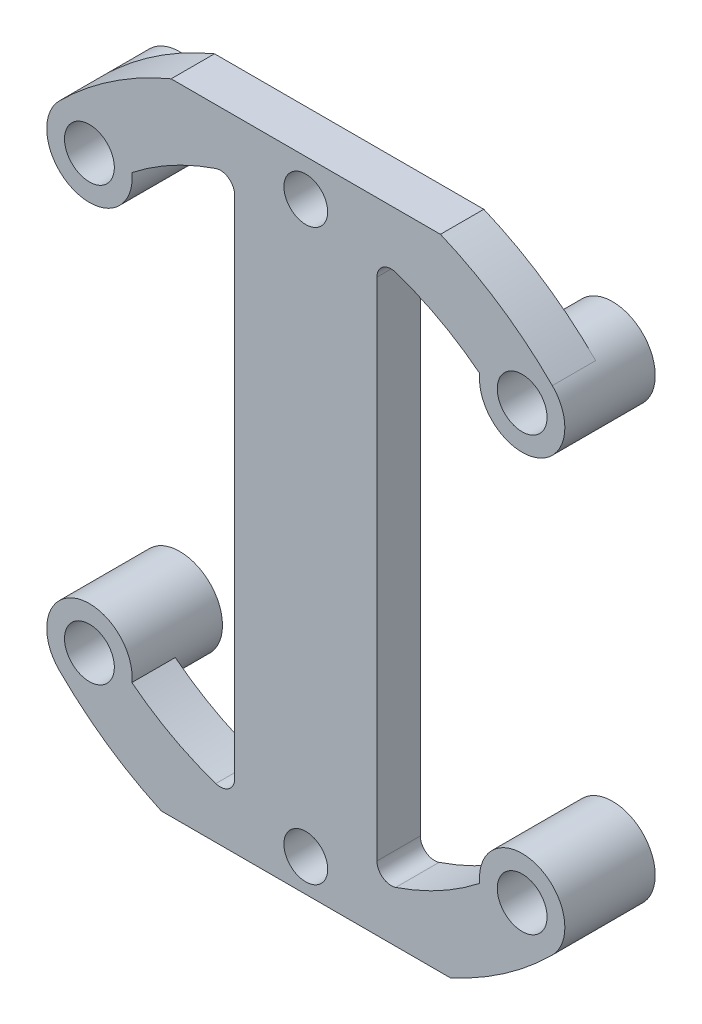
ISO-10303-21;
HEADER;
FILE_DESCRIPTION(('STEP AP214'),'2;1');
FILE_NAME('part.step','',(''),(''),'','','');
FILE_SCHEMA(('AUTOMOTIVE_DESIGN { 1 0 10303 214 1 1 1 1 }'));
ENDSEC;
DATA;
#1=APPLICATION_CONTEXT('core data for automotive mechanical design processes');
#2=APPLICATION_PROTOCOL_DEFINITION('international standard','automotive_design',2000,#1);
#3=PRODUCT_CONTEXT('',#1,'mechanical');
#4=PRODUCT('Part','Part','',(#3));
#5=PRODUCT_RELATED_PRODUCT_CATEGORY('part','',(#4));
#6=PRODUCT_DEFINITION_FORMATION('','',#4);
#7=PRODUCT_DEFINITION_CONTEXT('part definition',#1,'design');
#8=PRODUCT_DEFINITION('design','',#6,#7);
#9=PRODUCT_DEFINITION_SHAPE('','',#8);
#10=(LENGTH_UNIT() NAMED_UNIT(*) SI_UNIT(.MILLI.,.METRE.));
#11=(NAMED_UNIT(*) PLANE_ANGLE_UNIT() SI_UNIT($,.RADIAN.));
#12=(NAMED_UNIT(*) SI_UNIT($,.STERADIAN.) SOLID_ANGLE_UNIT());
#13=UNCERTAINTY_MEASURE_WITH_UNIT(LENGTH_MEASURE(1.E-05),#10,'distance_accuracy_value','');
#14=(GEOMETRIC_REPRESENTATION_CONTEXT(3) GLOBAL_UNCERTAINTY_ASSIGNED_CONTEXT((#13)) GLOBAL_UNIT_ASSIGNED_CONTEXT((#10,
#11,#12)) REPRESENTATION_CONTEXT('',''));
#15=CARTESIAN_POINT('',(0.,0.,0.));
#16=DIRECTION('',(0.,0.,1.));
#17=DIRECTION('',(1.,0.,0.));
#18=AXIS2_PLACEMENT_3D('',#15,#16,#17);
#19=CARTESIAN_POINT('',(-6.,-17.7640789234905,0.));
#20=DIRECTION('',(0.,0.,1.));
#21=DIRECTION('',(1.,0.,0.));
#22=AXIS2_PLACEMENT_3D('',#19,#20,#21);
#23=CYLINDRICAL_SURFACE('',#22,1.);
#24=DIRECTION('',(0.,0.,1.));
#25=VECTOR('',#24,1.);
#26=CARTESIAN_POINT('',(-6.32,-18.7114964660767,0.));
#27=LINE('',#26,#25);
#28=CARTESIAN_POINT('',(-6.32000000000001,-18.7114964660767,3.048));
#29=VERTEX_POINT('',#28);
#30=CARTESIAN_POINT('',(-6.32000000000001,-18.7114964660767,0.));
#31=VERTEX_POINT('',#30);
#32=EDGE_CURVE('E188',#29,#31,#27,.F.);
#33=ORIENTED_EDGE('',*,*,#32,.F.);
#34=CARTESIAN_POINT('',(-6.,-17.7640789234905,3.048));
#35=DIRECTION('',(0.,0.,1.));
#36=DIRECTION('',(1.,0.,0.));
#37=AXIS2_PLACEMENT_3D('',#34,#35,#36);
#38=CIRCLE('',#37,1.);
#39=CARTESIAN_POINT('',(-5.,-17.7640789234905,3.048));
#40=VERTEX_POINT('',#39);
#41=EDGE_CURVE('E55',#29,#40,#38,.T.);
#42=ORIENTED_EDGE('',*,*,#41,.T.);
#43=DIRECTION('',(0.,0.,-1.));
#44=VECTOR('',#43,1.);
#45=CARTESIAN_POINT('',(-5.,-17.7640789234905,0.));
#46=LINE('',#45,#44);
#47=CARTESIAN_POINT('',(-5.,-17.7640789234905,0.));
#48=VERTEX_POINT('',#47);
#49=EDGE_CURVE('E448',#48,#40,#46,.F.);
#50=ORIENTED_EDGE('',*,*,#49,.F.);
#51=CARTESIAN_POINT('',(-6.,-17.7640789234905,0.));
#52=DIRECTION('',(0.,0.,1.));
#53=DIRECTION('',(1.,0.,0.));
#54=AXIS2_PLACEMENT_3D('',#51,#52,#53);
#55=CIRCLE('',#54,1.);
#56=EDGE_CURVE('E11',#48,#31,#55,.F.);
#57=ORIENTED_EDGE('',*,*,#56,.T.);
#58=EDGE_LOOP('',(#33,#42,#50,#57));
#59=FACE_BOUND('',#58,.T.);
#60=ADVANCED_FACE('F47',(#59),#23,.F.);
#61=CARTESIAN_POINT('',(6.,-17.7640789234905,0.));
#62=DIRECTION('',(0.,0.,1.));
#63=DIRECTION('',(1.,0.,0.));
#64=AXIS2_PLACEMENT_3D('',#61,#62,#63);
#65=CYLINDRICAL_SURFACE('',#64,1.);
#66=DIRECTION('',(0.,0.,-1.));
#67=VECTOR('',#66,1.);
#68=CARTESIAN_POINT('',(5.,-17.7640789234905,0.));
#69=LINE('',#68,#67);
#70=CARTESIAN_POINT('',(5.,-17.7640789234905,3.048));
#71=VERTEX_POINT('',#70);
#72=CARTESIAN_POINT('',(5.,-17.7640789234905,0.));
#73=VERTEX_POINT('',#72);
#74=EDGE_CURVE('E432',#71,#73,#69,.T.);
#75=ORIENTED_EDGE('',*,*,#74,.F.);
#76=CARTESIAN_POINT('',(6.,-17.7640789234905,3.048));
#77=DIRECTION('',(0.,0.,1.));
#78=DIRECTION('',(1.,0.,0.));
#79=AXIS2_PLACEMENT_3D('',#76,#77,#78);
#80=CIRCLE('',#79,1.);
#81=CARTESIAN_POINT('',(6.32000000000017,-18.7114964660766,3.048));
#82=VERTEX_POINT('',#81);
#83=EDGE_CURVE('E440',#71,#82,#80,.T.);
#84=ORIENTED_EDGE('',*,*,#83,.T.);
#85=DIRECTION('',(0.,0.,1.));
#86=VECTOR('',#85,1.);
#87=CARTESIAN_POINT('',(6.32,-18.7114964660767,0.));
#88=LINE('',#87,#86);
#89=CARTESIAN_POINT('',(6.32000000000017,-18.7114964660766,0.));
#90=VERTEX_POINT('',#89);
#91=EDGE_CURVE('E436',#90,#82,#88,.T.);
#92=ORIENTED_EDGE('',*,*,#91,.F.);
#93=CARTESIAN_POINT('',(6.,-17.7640789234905,0.));
#94=DIRECTION('',(0.,0.,1.));
#95=DIRECTION('',(1.,0.,0.));
#96=AXIS2_PLACEMENT_3D('',#93,#94,#95);
#97=CIRCLE('',#96,1.);
#98=EDGE_CURVE('E443',#90,#73,#97,.F.);
#99=ORIENTED_EDGE('',*,*,#98,.T.);
#100=EDGE_LOOP('',(#75,#84,#92,#99));
#101=FACE_BOUND('',#100,.T.);
#102=ADVANCED_FACE('F505',(#101),#65,.F.);
#103=CARTESIAN_POINT('',(6.,17.7640789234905,0.));
#104=DIRECTION('',(0.,0.,1.));
#105=DIRECTION('',(1.,0.,0.));
#106=AXIS2_PLACEMENT_3D('',#103,#104,#105);
#107=CYLINDRICAL_SURFACE('',#106,1.);
#108=DIRECTION('',(0.,0.,1.));
#109=VECTOR('',#108,1.);
#110=CARTESIAN_POINT('',(6.32,18.7114964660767,0.));
#111=LINE('',#110,#109);
#112=CARTESIAN_POINT('',(6.32,18.7114964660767,3.048));
#113=VERTEX_POINT('',#112);
#114=CARTESIAN_POINT('',(6.32,18.7114964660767,0.));
#115=VERTEX_POINT('',#114);
#116=EDGE_CURVE('E417',#113,#115,#111,.F.);
#117=ORIENTED_EDGE('',*,*,#116,.F.);
#118=CARTESIAN_POINT('',(6.,17.7640789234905,3.048));
#119=DIRECTION('',(0.,0.,1.));
#120=DIRECTION('',(1.,0.,0.));
#121=AXIS2_PLACEMENT_3D('',#118,#119,#120);
#122=CIRCLE('',#121,1.);
#123=CARTESIAN_POINT('',(5.,17.7640789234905,3.048));
#124=VERTEX_POINT('',#123);
#125=EDGE_CURVE('E425',#113,#124,#122,.T.);
#126=ORIENTED_EDGE('',*,*,#125,.T.);
#127=DIRECTION('',(0.,0.,-1.));
#128=VECTOR('',#127,1.);
#129=CARTESIAN_POINT('',(5.,17.7640789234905,0.));
#130=LINE('',#129,#128);
#131=CARTESIAN_POINT('',(5.,17.7640789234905,0.));
#132=VERTEX_POINT('',#131);
#133=EDGE_CURVE('E421',#132,#124,#130,.F.);
#134=ORIENTED_EDGE('',*,*,#133,.F.);
#135=CARTESIAN_POINT('',(6.,17.7640789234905,0.));
#136=DIRECTION('',(0.,0.,1.));
#137=DIRECTION('',(1.,0.,0.));
#138=AXIS2_PLACEMENT_3D('',#135,#136,#137);
#139=CIRCLE('',#138,1.);
#140=EDGE_CURVE('E429',#132,#115,#139,.F.);
#141=ORIENTED_EDGE('',*,*,#140,.T.);
#142=EDGE_LOOP('',(#117,#126,#134,#141));
#143=FACE_BOUND('',#142,.T.);
#144=ADVANCED_FACE('F498',(#143),#107,.F.);
#145=CARTESIAN_POINT('',(-6.,17.7640789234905,0.));
#146=DIRECTION('',(0.,0.,1.));
#147=DIRECTION('',(1.,0.,0.));
#148=AXIS2_PLACEMENT_3D('',#145,#146,#147);
#149=CYLINDRICAL_SURFACE('',#148,1.);
#150=DIRECTION('',(0.,0.,-1.));
#151=VECTOR('',#150,1.);
#152=CARTESIAN_POINT('',(-5.,17.7640789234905,0.));
#153=LINE('',#152,#151);
#154=CARTESIAN_POINT('',(-5.,17.7640789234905,3.048));
#155=VERTEX_POINT('',#154);
#156=CARTESIAN_POINT('',(-5.,17.7640789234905,0.));
#157=VERTEX_POINT('',#156);
#158=EDGE_CURVE('E403',#155,#157,#153,.T.);
#159=ORIENTED_EDGE('',*,*,#158,.F.);
#160=CARTESIAN_POINT('',(-6.,17.7640789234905,3.048));
#161=DIRECTION('',(0.,0.,1.));
#162=DIRECTION('',(1.,0.,0.));
#163=AXIS2_PLACEMENT_3D('',#160,#161,#162);
#164=CIRCLE('',#163,1.);
#165=CARTESIAN_POINT('',(-6.32,18.7114964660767,3.048));
#166=VERTEX_POINT('',#165);
#167=EDGE_CURVE('E411',#155,#166,#164,.T.);
#168=ORIENTED_EDGE('',*,*,#167,.T.);
#169=DIRECTION('',(0.,0.,1.));
#170=VECTOR('',#169,1.);
#171=CARTESIAN_POINT('',(-6.32,18.7114964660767,0.));
#172=LINE('',#171,#170);
#173=CARTESIAN_POINT('',(-6.32,18.7114964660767,0.));
#174=VERTEX_POINT('',#173);
#175=EDGE_CURVE('E407',#174,#166,#172,.T.);
#176=ORIENTED_EDGE('',*,*,#175,.F.);
#177=CARTESIAN_POINT('',(-6.,17.7640789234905,0.));
#178=DIRECTION('',(0.,0.,1.));
#179=DIRECTION('',(1.,0.,0.));
#180=AXIS2_PLACEMENT_3D('',#177,#178,#179);
#181=CIRCLE('',#180,1.);
#182=EDGE_CURVE('E414',#174,#157,#181,.F.);
#183=ORIENTED_EDGE('',*,*,#182,.T.);
#184=EDGE_LOOP('',(#159,#168,#176,#183));
#185=FACE_BOUND('',#184,.T.);
#186=ADVANCED_FACE('F462',(#185),#149,.F.);
#187=CARTESIAN_POINT('',(0.,0.,0.));
#188=DIRECTION('',(0.,0.,1.));
#189=DIRECTION('',(1.,0.,0.));
#190=AXIS2_PLACEMENT_3D('',#187,#188,#189);
#191=PLANE('',#190);
#192=CARTESIAN_POINT('',(-15.2027957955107,15.2027957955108,0.));
#193=DIRECTION('',(0.,0.,1.));
#194=DIRECTION('',(1.,0.,0.));
#195=AXIS2_PLACEMENT_3D('',#192,#193,#194);
#196=CIRCLE('',#195,1.75);
#197=CARTESIAN_POINT('',(-16.9527957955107,15.2027957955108,0.));
#198=VERTEX_POINT('',#197);
#199=EDGE_CURVE('E249',#198,#198,#196,.T.);
#200=ORIENTED_EDGE('',*,*,#199,.T.);
#201=EDGE_LOOP('',(#200));
#202=FACE_BOUND('',#201,.T.);
#203=CARTESIAN_POINT('',(-15.2027957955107,15.2027957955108,0.));
#204=DIRECTION('',(0.,0.,1.));
#205=DIRECTION('',(1.,0.,0.));
#206=AXIS2_PLACEMENT_3D('',#203,#204,#205);
#207=CIRCLE('',#206,1.79849915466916);
#208=CARTESIAN_POINT('',(-13.4042966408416,15.2027957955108,0.));
#209=VERTEX_POINT('',#208);
#210=EDGE_CURVE('E399',#209,#209,#207,.T.);
#211=ORIENTED_EDGE('',*,*,#210,.F.);
#212=EDGE_LOOP('',(#211));
#213=FACE_BOUND('',#212,.T.);
#214=ADVANCED_FACE('F539',(#202,#213),#191,.F.);
#215=CARTESIAN_POINT('',(-15.2027957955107,-15.2027957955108,0.));
#216=DIRECTION('',(0.,0.,1.));
#217=DIRECTION('',(1.,0.,0.));
#218=AXIS2_PLACEMENT_3D('',#215,#216,#217);
#219=CIRCLE('',#218,1.75);
#220=CARTESIAN_POINT('',(-16.9527957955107,-15.2027957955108,0.));
#221=VERTEX_POINT('',#220);
#222=EDGE_CURVE('E300',#221,#221,#219,.T.);
#223=ORIENTED_EDGE('',*,*,#222,.T.);
#224=EDGE_LOOP('',(#223));
#225=FACE_BOUND('',#224,.T.);
#226=CARTESIAN_POINT('',(-15.2027957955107,-15.2027957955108,0.));
#227=DIRECTION('',(0.,0.,1.));
#228=DIRECTION('',(1.,0.,0.));
#229=AXIS2_PLACEMENT_3D('',#226,#227,#228);
#230=CIRCLE('',#229,1.76754924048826);
#231=CARTESIAN_POINT('',(-13.4352465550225,-15.2027957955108,0.));
#232=VERTEX_POINT('',#231);
#233=EDGE_CURVE('E395',#232,#232,#230,.T.);
#234=ORIENTED_EDGE('',*,*,#233,.F.);
#235=EDGE_LOOP('',(#234));
#236=FACE_BOUND('',#235,.T.);
#237=ADVANCED_FACE('F540',(#225,#236),#191,.F.);
#238=CARTESIAN_POINT('',(0.,0.,3.048));
#239=DIRECTION('',(0.,0.,1.));
#240=DIRECTION('',(1.,0.,0.));
#241=AXIS2_PLACEMENT_3D('',#238,#239,#240);
#242=PLANE('',#241);
#243=ORIENTED_EDGE('',*,*,#83,.F.);
#244=DIRECTION('',(0.,1.,0.));
#245=VECTOR('',#244,1.);
#246=CARTESIAN_POINT('',(5.,-12.2027957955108,3.048));
#247=LINE('',#246,#245);
#248=EDGE_CURVE('E344',#71,#124,#247,.T.);
#249=ORIENTED_EDGE('',*,*,#248,.T.);
#250=ORIENTED_EDGE('',*,*,#125,.F.);
#251=CARTESIAN_POINT('',(0.,0.,3.048));
#252=DIRECTION('',(0.,0.,1.));
#253=DIRECTION('',(1.,0.,0.));
#254=AXIS2_PLACEMENT_3D('',#251,#252,#253);
#255=CIRCLE('',#254,19.75);
#256=CARTESIAN_POINT('',(12.2192139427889,15.5162273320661,3.048));
#257=VERTEX_POINT('',#256);
#258=EDGE_CURVE('E278',#257,#113,#255,.T.);
#259=ORIENTED_EDGE('',*,*,#258,.F.);
#260=CARTESIAN_POINT('',(15.2027957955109,15.2027957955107,3.048));
#261=DIRECTION('',(0.,0.,-1.));
#262=DIRECTION('',(1.,0.,0.));
#263=AXIS2_PLACEMENT_3D('',#260,#261,#262);
#264=CIRCLE('',#263,2.99999999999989);
#265=CARTESIAN_POINT('',(17.3241161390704,17.3241161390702,3.048));
#266=VERTEX_POINT('',#265);
#267=EDGE_CURVE('E237',#266,#257,#264,.T.);
#268=ORIENTED_EDGE('',*,*,#267,.F.);
#269=CARTESIAN_POINT('',(0.,0.,3.048));
#270=DIRECTION('',(0.,0.,1.));
#271=DIRECTION('',(1.,0.,0.));
#272=AXIS2_PLACEMENT_3D('',#269,#270,#271);
#273=CIRCLE('',#272,24.5);
#274=CARTESIAN_POINT('',(9.46114835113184,22.5994838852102,3.048));
#275=VERTEX_POINT('',#274);
#276=EDGE_CURVE('E347',#266,#275,#273,.T.);
#277=ORIENTED_EDGE('',*,*,#276,.T.);
#278=DIRECTION('',(-1.,0.,0.));
#279=VECTOR('',#278,1.);
#280=CARTESIAN_POINT('',(-9.46114835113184,22.5994838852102,3.048));
#281=LINE('',#280,#279);
#282=CARTESIAN_POINT('',(-9.46114835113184,22.5994838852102,3.048));
#283=VERTEX_POINT('',#282);
#284=EDGE_CURVE('E350',#275,#283,#281,.T.);
#285=ORIENTED_EDGE('',*,*,#284,.T.);
#286=CARTESIAN_POINT('',(0.,0.,3.048));
#287=DIRECTION('',(0.,0.,1.));
#288=DIRECTION('',(1.,0.,0.));
#289=AXIS2_PLACEMENT_3D('',#286,#287,#288);
#290=CIRCLE('',#289,24.5);
#291=CARTESIAN_POINT('',(-17.3241161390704,17.3241161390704,3.048));
#292=VERTEX_POINT('',#291);
#293=EDGE_CURVE('E353',#283,#292,#290,.T.);
#294=ORIENTED_EDGE('',*,*,#293,.T.);
#295=CARTESIAN_POINT('',(-15.2027957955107,15.2027957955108,3.048));
#296=DIRECTION('',(0.,0.,-1.));
#297=DIRECTION('',(1.,0.,0.));
#298=AXIS2_PLACEMENT_3D('',#295,#296,#297);
#299=CIRCLE('',#298,2.99999999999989);
#300=CARTESIAN_POINT('',(-12.2192139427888,15.5162273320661,3.048));
#301=VERTEX_POINT('',#300);
#302=EDGE_CURVE('E192',#301,#292,#299,.T.);
#303=ORIENTED_EDGE('',*,*,#302,.F.);
#304=CARTESIAN_POINT('',(0.,0.,3.048));
#305=DIRECTION('',(0.,0.,1.));
#306=DIRECTION('',(1.,0.,0.));
#307=AXIS2_PLACEMENT_3D('',#304,#305,#306);
#308=CIRCLE('',#307,19.75);
#309=EDGE_CURVE('E240',#166,#301,#308,.T.);
#310=ORIENTED_EDGE('',*,*,#309,.F.);
#311=ORIENTED_EDGE('',*,*,#167,.F.);
#312=DIRECTION('',(0.,-1.,0.));
#313=VECTOR('',#312,1.);
#314=CARTESIAN_POINT('',(-5.,-12.2027957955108,3.048));
#315=LINE('',#314,#313);
#316=EDGE_CURVE('E329',#155,#40,#315,.T.);
#317=ORIENTED_EDGE('',*,*,#316,.T.);
#318=ORIENTED_EDGE('',*,*,#41,.F.);
#319=CARTESIAN_POINT('',(0.,0.,3.048));
#320=DIRECTION('',(0.,0.,1.));
#321=DIRECTION('',(1.,0.,0.));
#322=AXIS2_PLACEMENT_3D('',#319,#320,#321);
#323=CIRCLE('',#322,19.75);
#324=CARTESIAN_POINT('',(-12.2192139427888,-15.5162273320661,3.048));
#325=VERTEX_POINT('',#324);
#326=EDGE_CURVE('E236',#325,#29,#323,.T.);
#327=ORIENTED_EDGE('',*,*,#326,.F.);
#328=CARTESIAN_POINT('',(-15.2027957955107,-15.2027957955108,3.048));
#329=DIRECTION('',(0.,0.,-1.));
#330=DIRECTION('',(1.,0.,0.));
#331=AXIS2_PLACEMENT_3D('',#328,#329,#330);
#332=CIRCLE('',#331,2.99999999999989);
#333=CARTESIAN_POINT('',(-17.3241161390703,-17.3241161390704,3.048));
#334=VERTEX_POINT('',#333);
#335=EDGE_CURVE('E200',#334,#325,#332,.T.);
#336=ORIENTED_EDGE('',*,*,#335,.F.);
#337=CARTESIAN_POINT('',(0.,0.,3.048));
#338=DIRECTION('',(0.,0.,1.));
#339=DIRECTION('',(1.,0.,0.));
#340=AXIS2_PLACEMENT_3D('',#337,#338,#339);
#341=CIRCLE('',#340,24.5);
#342=CARTESIAN_POINT('',(-10.1533608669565,-22.2970684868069,3.048));
#343=VERTEX_POINT('',#342);
#344=EDGE_CURVE('E333',#334,#343,#341,.T.);
#345=ORIENTED_EDGE('',*,*,#344,.T.);
#346=DIRECTION('',(1.,0.,0.));
#347=VECTOR('',#346,1.);
#348=CARTESIAN_POINT('',(-10.1533608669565,-22.2970684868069,3.048));
#349=LINE('',#348,#347);
#350=CARTESIAN_POINT('',(10.1533608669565,-22.2970684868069,3.048));
#351=VERTEX_POINT('',#350);
#352=EDGE_CURVE('E337',#343,#351,#349,.T.);
#353=ORIENTED_EDGE('',*,*,#352,.T.);
#354=CARTESIAN_POINT('',(0.,0.,3.048));
#355=DIRECTION('',(0.,0.,1.));
#356=DIRECTION('',(1.,0.,0.));
#357=AXIS2_PLACEMENT_3D('',#354,#355,#356);
#358=CIRCLE('',#357,24.5);
#359=CARTESIAN_POINT('',(17.3241161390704,-17.3241161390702,3.048));
#360=VERTEX_POINT('',#359);
#361=EDGE_CURVE('E340',#351,#360,#358,.T.);
#362=ORIENTED_EDGE('',*,*,#361,.T.);
#363=CARTESIAN_POINT('',(15.2027957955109,-15.2027957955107,3.048));
#364=DIRECTION('',(0.,0.,-1.));
#365=DIRECTION('',(1.,0.,0.));
#366=AXIS2_PLACEMENT_3D('',#363,#364,#365);
#367=CIRCLE('',#366,2.99999999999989);
#368=CARTESIAN_POINT('',(12.2192139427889,-15.5162273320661,3.048));
#369=VERTEX_POINT('',#368);
#370=EDGE_CURVE('E271',#369,#360,#367,.T.);
#371=ORIENTED_EDGE('',*,*,#370,.F.);
#372=CARTESIAN_POINT('',(0.,0.,3.048));
#373=DIRECTION('',(0.,0.,1.));
#374=DIRECTION('',(1.,0.,0.));
#375=AXIS2_PLACEMENT_3D('',#372,#373,#374);
#376=CIRCLE('',#375,19.75);
#377=EDGE_CURVE('E274',#82,#369,#376,.T.);
#378=ORIENTED_EDGE('',*,*,#377,.F.);
#379=EDGE_LOOP('',(#243,#249,#250,#259,#268,#277,#285,#294,#303,#310,#311,#317,#318,#327,#336,
#345,#353,#362,#371,#378));
#380=FACE_BOUND('',#379,.T.);
#381=CARTESIAN_POINT('',(0.,20.,3.048));
#382=DIRECTION('',(0.,0.,1.));
#383=DIRECTION('',(1.,0.,0.));
#384=AXIS2_PLACEMENT_3D('',#381,#382,#383);
#385=CIRCLE('',#384,1.5367);
#386=CARTESIAN_POINT('',(-1.5367,20.,3.048));
#387=VERTEX_POINT('',#386);
#388=EDGE_CURVE('E321',#387,#387,#385,.T.);
#389=ORIENTED_EDGE('',*,*,#388,.F.);
#390=EDGE_LOOP('',(#389));
#391=FACE_BOUND('',#390,.T.);
#392=CARTESIAN_POINT('',(0.,-20.,3.048));
#393=DIRECTION('',(0.,0.,1.));
#394=DIRECTION('',(1.,0.,0.));
#395=AXIS2_PLACEMENT_3D('',#392,#393,#394);
#396=CIRCLE('',#395,1.5367);
#397=CARTESIAN_POINT('',(-1.5367,-20.,3.048));
#398=VERTEX_POINT('',#397);
#399=EDGE_CURVE('E313',#398,#398,#396,.T.);
#400=ORIENTED_EDGE('',*,*,#399,.F.);
#401=EDGE_LOOP('',(#400));
#402=FACE_BOUND('',#401,.T.);
#403=CARTESIAN_POINT('',(-15.2027957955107,-15.2027957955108,3.048));
#404=DIRECTION('',(0.,0.,1.));
#405=DIRECTION('',(1.,0.,0.));
#406=AXIS2_PLACEMENT_3D('',#403,#404,#405);
#407=CIRCLE('',#406,1.75);
#408=CARTESIAN_POINT('',(-16.9527957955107,-15.2027957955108,3.048));
#409=VERTEX_POINT('',#408);
#410=EDGE_CURVE('E301',#409,#409,#407,.T.);
#411=ORIENTED_EDGE('',*,*,#410,.F.);
#412=EDGE_LOOP('',(#411));
#413=FACE_BOUND('',#412,.T.);
#414=CARTESIAN_POINT('',(-15.2027957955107,15.2027957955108,3.048));
#415=DIRECTION('',(0.,0.,1.));
#416=DIRECTION('',(1.,0.,0.));
#417=AXIS2_PLACEMENT_3D('',#414,#415,#416);
#418=CIRCLE('',#417,1.75);
#419=CARTESIAN_POINT('',(-16.9527957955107,15.2027957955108,3.048));
#420=VERTEX_POINT('',#419);
#421=EDGE_CURVE('E289',#420,#420,#418,.T.);
#422=ORIENTED_EDGE('',*,*,#421,.F.);
#423=EDGE_LOOP('',(#422));
#424=FACE_BOUND('',#423,.T.);
#425=CARTESIAN_POINT('',(15.2027957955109,15.2027957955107,3.048));
#426=DIRECTION('',(0.,0.,1.));
#427=DIRECTION('',(1.,0.,0.));
#428=AXIS2_PLACEMENT_3D('',#425,#426,#427);
#429=CIRCLE('',#428,1.75);
#430=CARTESIAN_POINT('',(13.4527957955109,15.2027957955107,3.048));
#431=VERTEX_POINT('',#430);
#432=EDGE_CURVE('E293',#431,#431,#429,.T.);
#433=ORIENTED_EDGE('',*,*,#432,.F.);
#434=EDGE_LOOP('',(#433));
#435=FACE_BOUND('',#434,.T.);
#436=CARTESIAN_POINT('',(15.2027957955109,-15.2027957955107,3.048));
#437=DIRECTION('',(0.,0.,1.));
#438=DIRECTION('',(1.,0.,0.));
#439=AXIS2_PLACEMENT_3D('',#436,#437,#438);
#440=CIRCLE('',#439,1.75);
#441=CARTESIAN_POINT('',(13.4527957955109,-15.2027957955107,3.048));
#442=VERTEX_POINT('',#441);
#443=EDGE_CURVE('E305',#442,#442,#440,.T.);
#444=ORIENTED_EDGE('',*,*,#443,.F.);
#445=EDGE_LOOP('',(#444));
#446=FACE_BOUND('',#445,.T.);
#447=ADVANCED_FACE('F455',(#380,#391,#402,#413,#424,#435,#446),#242,.T.);
#448=ORIENTED_EDGE('',*,*,#98,.F.);
#449=CARTESIAN_POINT('',(0.,0.,0.));
#450=DIRECTION('',(0.,0.,1.));
#451=DIRECTION('',(1.,0.,0.));
#452=AXIS2_PLACEMENT_3D('',#449,#450,#451);
#453=CIRCLE('',#452,19.75);
#454=CARTESIAN_POINT('',(12.2192139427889,-15.5162273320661,0.));
#455=VERTEX_POINT('',#454);
#456=EDGE_CURVE('E259',#90,#455,#453,.T.);
#457=ORIENTED_EDGE('',*,*,#456,.T.);
#458=CARTESIAN_POINT('',(15.2027957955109,-15.2027957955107,0.));
#459=DIRECTION('',(0.,0.,1.));
#460=DIRECTION('',(1.,0.,0.));
#461=AXIS2_PLACEMENT_3D('',#458,#459,#460);
#462=CIRCLE('',#461,2.99999999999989);
#463=CARTESIAN_POINT('',(17.3241161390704,-17.3241161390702,0.));
#464=VERTEX_POINT('',#463);
#465=EDGE_CURVE('E211',#455,#464,#462,.T.);
#466=ORIENTED_EDGE('',*,*,#465,.T.);
#467=CARTESIAN_POINT('',(0.,0.,0.));
#468=DIRECTION('',(0.,0.,1.));
#469=DIRECTION('',(1.,0.,0.));
#470=AXIS2_PLACEMENT_3D('',#467,#468,#469);
#471=CIRCLE('',#470,24.5);
#472=CARTESIAN_POINT('',(10.1533608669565,-22.2970684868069,0.));
#473=VERTEX_POINT('',#472);
#474=EDGE_CURVE('E366',#473,#464,#471,.T.);
#475=ORIENTED_EDGE('',*,*,#474,.F.);
#476=DIRECTION('',(1.,0.,0.));
#477=VECTOR('',#476,1.);
#478=CARTESIAN_POINT('',(-10.1533608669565,-22.2970684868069,0.));
#479=LINE('',#478,#477);
#480=CARTESIAN_POINT('',(-10.1533608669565,-22.2970684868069,0.));
#481=VERTEX_POINT('',#480);
#482=EDGE_CURVE('E363',#481,#473,#479,.T.);
#483=ORIENTED_EDGE('',*,*,#482,.F.);
#484=CARTESIAN_POINT('',(0.,0.,0.));
#485=DIRECTION('',(0.,0.,1.));
#486=DIRECTION('',(1.,0.,0.));
#487=AXIS2_PLACEMENT_3D('',#484,#485,#486);
#488=CIRCLE('',#487,24.5);
#489=CARTESIAN_POINT('',(-17.3241161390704,-17.3241161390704,0.));
#490=VERTEX_POINT('',#489);
#491=EDGE_CURVE('E209',#490,#481,#488,.T.);
#492=ORIENTED_EDGE('',*,*,#491,.F.);
#493=CARTESIAN_POINT('',(-15.2027957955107,-15.2027957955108,0.));
#494=DIRECTION('',(0.,0.,1.));
#495=DIRECTION('',(1.,0.,0.));
#496=AXIS2_PLACEMENT_3D('',#493,#494,#495);
#497=CIRCLE('',#496,3.);
#498=CARTESIAN_POINT('',(-12.2192139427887,-15.5162273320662,0.));
#499=VERTEX_POINT('',#498);
#500=EDGE_CURVE('E199',#490,#499,#497,.T.);
#501=ORIENTED_EDGE('',*,*,#500,.T.);
#502=CARTESIAN_POINT('',(0.,0.,0.));
#503=DIRECTION('',(0.,0.,1.));
#504=DIRECTION('',(1.,0.,0.));
#505=AXIS2_PLACEMENT_3D('',#502,#503,#504);
#506=CIRCLE('',#505,19.75);
#507=EDGE_CURVE('E182',#499,#31,#506,.T.);
#508=ORIENTED_EDGE('',*,*,#507,.T.);
#509=ORIENTED_EDGE('',*,*,#56,.F.);
#510=DIRECTION('',(0.,-1.,0.));
#511=VECTOR('',#510,1.);
#512=CARTESIAN_POINT('',(-5.,-12.2027957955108,0.));
#513=LINE('',#512,#511);
#514=EDGE_CURVE('E325',#157,#48,#513,.T.);
#515=ORIENTED_EDGE('',*,*,#514,.F.);
#516=ORIENTED_EDGE('',*,*,#182,.F.);
#517=CARTESIAN_POINT('',(0.,0.,0.));
#518=DIRECTION('',(0.,0.,1.));
#519=DIRECTION('',(1.,0.,0.));
#520=AXIS2_PLACEMENT_3D('',#517,#518,#519);
#521=CIRCLE('',#520,19.75);
#522=CARTESIAN_POINT('',(-12.2192139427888,15.5162273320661,0.));
#523=VERTEX_POINT('',#522);
#524=EDGE_CURVE('E191',#174,#523,#521,.T.);
#525=ORIENTED_EDGE('',*,*,#524,.T.);
#526=CARTESIAN_POINT('',(-15.2027957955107,15.2027957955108,0.));
#527=DIRECTION('',(0.,0.,1.));
#528=DIRECTION('',(1.,0.,0.));
#529=AXIS2_PLACEMENT_3D('',#526,#527,#528);
#530=CIRCLE('',#529,2.99999999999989);
#531=CARTESIAN_POINT('',(-17.3241161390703,17.3241161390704,0.));
#532=VERTEX_POINT('',#531);
#533=EDGE_CURVE('E227',#523,#532,#530,.T.);
#534=ORIENTED_EDGE('',*,*,#533,.T.);
#535=CARTESIAN_POINT('',(0.,0.,0.));
#536=DIRECTION('',(0.,0.,1.));
#537=DIRECTION('',(1.,0.,0.));
#538=AXIS2_PLACEMENT_3D('',#535,#536,#537);
#539=CIRCLE('',#538,24.5);
#540=CARTESIAN_POINT('',(-9.46114835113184,22.5994838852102,0.));
#541=VERTEX_POINT('',#540);
#542=EDGE_CURVE('E334',#541,#532,#539,.T.);
#543=ORIENTED_EDGE('',*,*,#542,.F.);
#544=DIRECTION('',(-1.,0.,0.));
#545=VECTOR('',#544,1.);
#546=CARTESIAN_POINT('',(-9.46114835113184,22.5994838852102,0.));
#547=LINE('',#546,#545);
#548=CARTESIAN_POINT('',(9.46114835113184,22.5994838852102,0.));
#549=VERTEX_POINT('',#548);
#550=EDGE_CURVE('E375',#549,#541,#547,.T.);
#551=ORIENTED_EDGE('',*,*,#550,.F.);
#552=CARTESIAN_POINT('',(0.,0.,0.));
#553=DIRECTION('',(0.,0.,1.));
#554=DIRECTION('',(1.,0.,0.));
#555=AXIS2_PLACEMENT_3D('',#552,#553,#554);
#556=CIRCLE('',#555,24.5);
#557=CARTESIAN_POINT('',(17.3241161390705,17.3241161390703,0.));
#558=VERTEX_POINT('',#557);
#559=EDGE_CURVE('E372',#558,#549,#556,.T.);
#560=ORIENTED_EDGE('',*,*,#559,.F.);
#561=CARTESIAN_POINT('',(15.2027957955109,15.2027957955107,0.));
#562=DIRECTION('',(0.,0.,1.));
#563=DIRECTION('',(1.,0.,0.));
#564=AXIS2_PLACEMENT_3D('',#561,#562,#563);
#565=CIRCLE('',#564,3.);
#566=CARTESIAN_POINT('',(12.2192139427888,15.5162273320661,0.));
#567=VERTEX_POINT('',#566);
#568=EDGE_CURVE('E217',#558,#567,#565,.T.);
#569=ORIENTED_EDGE('',*,*,#568,.T.);
#570=CARTESIAN_POINT('',(0.,0.,0.));
#571=DIRECTION('',(0.,0.,1.));
#572=DIRECTION('',(1.,0.,0.));
#573=AXIS2_PLACEMENT_3D('',#570,#571,#572);
#574=CIRCLE('',#573,19.75);
#575=EDGE_CURVE('E275',#567,#115,#574,.T.);
#576=ORIENTED_EDGE('',*,*,#575,.T.);
#577=ORIENTED_EDGE('',*,*,#140,.F.);
#578=DIRECTION('',(0.,1.,0.));
#579=VECTOR('',#578,1.);
#580=CARTESIAN_POINT('',(5.,-12.2027957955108,0.));
#581=LINE('',#580,#579);
#582=EDGE_CURVE('E369',#73,#132,#581,.T.);
#583=ORIENTED_EDGE('',*,*,#582,.F.);
#584=EDGE_LOOP('',(#448,#457,#466,#475,#483,#492,#501,#508,#509,#515,#516,#525,#534,#543,#551,
#560,#569,#576,#577,#583));
#585=FACE_BOUND('',#584,.T.);
#586=CARTESIAN_POINT('',(0.,20.,0.));
#587=DIRECTION('',(0.,0.,1.));
#588=DIRECTION('',(1.,0.,0.));
#589=AXIS2_PLACEMENT_3D('',#586,#587,#588);
#590=CIRCLE('',#589,1.5367);
#591=CARTESIAN_POINT('',(-1.5367,20.,0.));
#592=VERTEX_POINT('',#591);
#593=EDGE_CURVE('E317',#592,#592,#590,.T.);
#594=ORIENTED_EDGE('',*,*,#593,.T.);
#595=EDGE_LOOP('',(#594));
#596=FACE_BOUND('',#595,.T.);
#597=CARTESIAN_POINT('',(0.,-20.,0.));
#598=DIRECTION('',(0.,0.,1.));
#599=DIRECTION('',(1.,0.,0.));
#600=AXIS2_PLACEMENT_3D('',#597,#598,#599);
#601=CIRCLE('',#600,1.5367);
#602=CARTESIAN_POINT('',(-1.5367,-20.,0.));
#603=VERTEX_POINT('',#602);
#604=EDGE_CURVE('E312',#603,#603,#601,.T.);
#605=ORIENTED_EDGE('',*,*,#604,.T.);
#606=EDGE_LOOP('',(#605));
#607=FACE_BOUND('',#606,.T.);
#608=ADVANCED_FACE('F206',(#585,#596,#607),#191,.F.);
#609=CARTESIAN_POINT('',(0.,0.,3.048));
#610=DIRECTION('',(0.,0.,-1.));
#611=DIRECTION('',(-1.,0.,0.));
#612=AXIS2_PLACEMENT_3D('',#609,#610,#611);
#613=CYLINDRICAL_SURFACE('',#612,24.5);
#614=DIRECTION('',(0.,0.,1.));
#615=VECTOR('',#614,1.);
#616=CARTESIAN_POINT('',(-17.3241161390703,-17.3241161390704,0.));
#617=LINE('',#616,#615);
#618=EDGE_CURVE('E203',#490,#334,#617,.T.);
#619=ORIENTED_EDGE('',*,*,#618,.F.);
#620=ORIENTED_EDGE('',*,*,#491,.T.);
#621=DIRECTION('',(0.,0.,-1.));
#622=VECTOR('',#621,1.);
#623=CARTESIAN_POINT('',(-10.1533608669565,-22.2970684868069,3.048));
#624=LINE('',#623,#622);
#625=EDGE_CURVE('E391',#343,#481,#624,.T.);
#626=ORIENTED_EDGE('',*,*,#625,.F.);
#627=ORIENTED_EDGE('',*,*,#344,.F.);
#628=EDGE_LOOP('',(#619,#620,#626,#627));
#629=FACE_BOUND('',#628,.T.);
#630=ADVANCED_FACE('F529',(#629),#613,.T.);
#631=CARTESIAN_POINT('',(0.,0.,3.048));
#632=DIRECTION('',(0.,0.,-1.));
#633=DIRECTION('',(-1.,0.,0.));
#634=AXIS2_PLACEMENT_3D('',#631,#632,#633);
#635=CYLINDRICAL_SURFACE('',#634,24.5);
#636=DIRECTION('',(0.,0.,1.));
#637=VECTOR('',#636,1.);
#638=CARTESIAN_POINT('',(17.3241161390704,17.3241161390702,0.));
#639=LINE('',#638,#637);
#640=EDGE_CURVE('E255',#558,#266,#639,.T.);
#641=ORIENTED_EDGE('',*,*,#640,.F.);
#642=ORIENTED_EDGE('',*,*,#559,.T.);
#643=DIRECTION('',(0.,0.,-1.));
#644=VECTOR('',#643,1.);
#645=CARTESIAN_POINT('',(9.46114835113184,22.5994838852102,3.048));
#646=LINE('',#645,#644);
#647=EDGE_CURVE('E383',#275,#549,#646,.T.);
#648=ORIENTED_EDGE('',*,*,#647,.F.);
#649=ORIENTED_EDGE('',*,*,#276,.F.);
#650=EDGE_LOOP('',(#641,#642,#648,#649));
#651=FACE_BOUND('',#650,.T.);
#652=ADVANCED_FACE('F485',(#651),#635,.T.);
#653=CARTESIAN_POINT('',(-5.,-12.2027957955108,3.048));
#654=DIRECTION('',(1.,0.,0.));
#655=DIRECTION('',(0.,0.,-1.));
#656=AXIS2_PLACEMENT_3D('',#653,#654,#655);
#657=PLANE('',#656);
#658=ORIENTED_EDGE('',*,*,#514,.T.);
#659=ORIENTED_EDGE('',*,*,#49,.T.);
#660=ORIENTED_EDGE('',*,*,#316,.F.);
#661=ORIENTED_EDGE('',*,*,#158,.T.);
#662=EDGE_LOOP('',(#658,#659,#660,#661));
#663=FACE_BOUND('',#662,.T.);
#664=ADVANCED_FACE('F453',(#663),#657,.F.);
#665=CARTESIAN_POINT('',(-10.1533608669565,-22.2970684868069,3.048));
#666=DIRECTION('',(0.,1.,0.));
#667=DIRECTION('',(0.,0.,1.));
#668=AXIS2_PLACEMENT_3D('',#665,#666,#667);
#669=PLANE('',#668);
#670=ORIENTED_EDGE('',*,*,#482,.T.);
#671=DIRECTION('',(0.,0.,-1.));
#672=VECTOR('',#671,1.);
#673=CARTESIAN_POINT('',(10.1533608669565,-22.2970684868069,3.048));
#674=LINE('',#673,#672);
#675=EDGE_CURVE('E387',#351,#473,#674,.T.);
#676=ORIENTED_EDGE('',*,*,#675,.F.);
#677=ORIENTED_EDGE('',*,*,#352,.F.);
#678=ORIENTED_EDGE('',*,*,#625,.T.);
#679=EDGE_LOOP('',(#670,#676,#677,#678));
#680=FACE_BOUND('',#679,.T.);
#681=ADVANCED_FACE('F527',(#680),#669,.F.);
#682=CARTESIAN_POINT('',(0.,0.,3.048));
#683=DIRECTION('',(0.,0.,-1.));
#684=DIRECTION('',(-1.,0.,0.));
#685=AXIS2_PLACEMENT_3D('',#682,#683,#684);
#686=CYLINDRICAL_SURFACE('',#685,24.5);
#687=ORIENTED_EDGE('',*,*,#474,.T.);
#688=DIRECTION('',(0.,0.,1.));
#689=VECTOR('',#688,1.);
#690=CARTESIAN_POINT('',(17.3241161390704,-17.3241161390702,0.));
#691=LINE('',#690,#689);
#692=EDGE_CURVE('E230',#464,#360,#691,.T.);
#693=ORIENTED_EDGE('',*,*,#692,.T.);
#694=ORIENTED_EDGE('',*,*,#361,.F.);
#695=ORIENTED_EDGE('',*,*,#675,.T.);
#696=EDGE_LOOP('',(#687,#693,#694,#695));
#697=FACE_BOUND('',#696,.T.);
#698=ADVANCED_FACE('F521',(#697),#686,.T.);
#699=CARTESIAN_POINT('',(5.,-12.2027957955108,3.048));
#700=DIRECTION('',(-1.,0.,0.));
#701=DIRECTION('',(0.,0.,1.));
#702=AXIS2_PLACEMENT_3D('',#699,#700,#701);
#703=PLANE('',#702);
#704=ORIENTED_EDGE('',*,*,#248,.F.);
#705=ORIENTED_EDGE('',*,*,#74,.T.);
#706=ORIENTED_EDGE('',*,*,#582,.T.);
#707=ORIENTED_EDGE('',*,*,#133,.T.);
#708=EDGE_LOOP('',(#704,#705,#706,#707));
#709=FACE_BOUND('',#708,.T.);
#710=ADVANCED_FACE('F502',(#709),#703,.F.);
#711=CARTESIAN_POINT('',(-9.46114835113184,22.5994838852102,3.048));
#712=DIRECTION('',(0.,-1.,0.));
#713=DIRECTION('',(0.,0.,-1.));
#714=AXIS2_PLACEMENT_3D('',#711,#712,#713);
#715=PLANE('',#714);
#716=ORIENTED_EDGE('',*,*,#550,.T.);
#717=DIRECTION('',(0.,0.,-1.));
#718=VECTOR('',#717,1.);
#719=CARTESIAN_POINT('',(-9.46114835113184,22.5994838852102,3.048));
#720=LINE('',#719,#718);
#721=EDGE_CURVE('E357',#283,#541,#720,.T.);
#722=ORIENTED_EDGE('',*,*,#721,.F.);
#723=ORIENTED_EDGE('',*,*,#284,.F.);
#724=ORIENTED_EDGE('',*,*,#647,.T.);
#725=EDGE_LOOP('',(#716,#722,#723,#724));
#726=FACE_BOUND('',#725,.T.);
#727=ADVANCED_FACE('F481',(#726),#715,.F.);
#728=CARTESIAN_POINT('',(0.,0.,3.048));
#729=DIRECTION('',(0.,0.,-1.));
#730=DIRECTION('',(-1.,0.,0.));
#731=AXIS2_PLACEMENT_3D('',#728,#729,#730);
#732=CYLINDRICAL_SURFACE('',#731,24.5);
#733=ORIENTED_EDGE('',*,*,#542,.T.);
#734=DIRECTION('',(0.,0.,1.));
#735=VECTOR('',#734,1.);
#736=CARTESIAN_POINT('',(-17.3241161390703,17.3241161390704,0.));
#737=LINE('',#736,#735);
#738=EDGE_CURVE('E245',#532,#292,#737,.T.);
#739=ORIENTED_EDGE('',*,*,#738,.T.);
#740=ORIENTED_EDGE('',*,*,#293,.F.);
#741=ORIENTED_EDGE('',*,*,#721,.T.);
#742=EDGE_LOOP('',(#733,#739,#740,#741));
#743=FACE_BOUND('',#742,.T.);
#744=ADVANCED_FACE('F476',(#743),#732,.T.);
#745=CARTESIAN_POINT('',(0.,20.,3.048));
#746=DIRECTION('',(0.,0.,-1.));
#747=DIRECTION('',(-1.,0.,0.));
#748=AXIS2_PLACEMENT_3D('',#745,#746,#747);
#749=CYLINDRICAL_SURFACE('',#748,1.5367);
#750=CARTESIAN_POINT('',(-1.5367,20.,3.048));
#751=CARTESIAN_POINT('',(-1.5367,20.,3.01625));
#752=CARTESIAN_POINT('',(-1.5367,20.,2.9845));
#753=CARTESIAN_POINT('',(-1.5367,20.,2.921));
#754=CARTESIAN_POINT('',(-1.5367,20.,2.88925));
#755=CARTESIAN_POINT('',(-1.5367,20.,2.82575));
#756=CARTESIAN_POINT('',(-1.5367,20.,2.794));
#757=CARTESIAN_POINT('',(-1.5367,20.,2.7305));
#758=CARTESIAN_POINT('',(-1.5367,20.,2.69875));
#759=CARTESIAN_POINT('',(-1.5367,20.,2.63525));
#760=CARTESIAN_POINT('',(-1.5367,20.,2.6035));
#761=CARTESIAN_POINT('',(-1.5367,20.,2.54));
#762=CARTESIAN_POINT('',(-1.5367,20.,2.50825));
#763=CARTESIAN_POINT('',(-1.5367,20.,2.44475));
#764=CARTESIAN_POINT('',(-1.5367,20.,2.413));
#765=CARTESIAN_POINT('',(-1.5367,20.,2.3495));
#766=CARTESIAN_POINT('',(-1.5367,20.,2.31775));
#767=CARTESIAN_POINT('',(-1.5367,20.,2.25425));
#768=CARTESIAN_POINT('',(-1.5367,20.,2.2225));
#769=CARTESIAN_POINT('',(-1.5367,20.,2.159));
#770=CARTESIAN_POINT('',(-1.5367,20.,2.12725));
#771=CARTESIAN_POINT('',(-1.5367,20.,2.06375));
#772=CARTESIAN_POINT('',(-1.5367,20.,2.032));
#773=CARTESIAN_POINT('',(-1.5367,20.,1.9685));
#774=CARTESIAN_POINT('',(-1.5367,20.,1.93675));
#775=CARTESIAN_POINT('',(-1.5367,20.,1.87325));
#776=CARTESIAN_POINT('',(-1.5367,20.,1.8415));
#777=CARTESIAN_POINT('',(-1.5367,20.,1.778));
#778=CARTESIAN_POINT('',(-1.5367,20.,1.74625));
#779=CARTESIAN_POINT('',(-1.5367,20.,1.68275));
#780=CARTESIAN_POINT('',(-1.5367,20.,1.651));
#781=CARTESIAN_POINT('',(-1.5367,20.,1.5875));
#782=CARTESIAN_POINT('',(-1.5367,20.,1.55575));
#783=CARTESIAN_POINT('',(-1.5367,20.,1.49225));
#784=CARTESIAN_POINT('',(-1.5367,20.,1.4605));
#785=CARTESIAN_POINT('',(-1.5367,20.,1.397));
#786=CARTESIAN_POINT('',(-1.5367,20.,1.36525));
#787=CARTESIAN_POINT('',(-1.5367,20.,1.30175));
#788=CARTESIAN_POINT('',(-1.5367,20.,1.27));
#789=CARTESIAN_POINT('',(-1.5367,20.,1.2065));
#790=CARTESIAN_POINT('',(-1.5367,20.,1.17475));
#791=CARTESIAN_POINT('',(-1.5367,20.,1.11125));
#792=CARTESIAN_POINT('',(-1.5367,20.,1.0795));
#793=CARTESIAN_POINT('',(-1.5367,20.,1.016));
#794=CARTESIAN_POINT('',(-1.5367,20.,0.98425));
#795=CARTESIAN_POINT('',(-1.5367,20.,0.92075));
#796=CARTESIAN_POINT('',(-1.5367,20.,0.889));
#797=CARTESIAN_POINT('',(-1.5367,20.,0.8255));
#798=CARTESIAN_POINT('',(-1.5367,20.,0.79375));
#799=CARTESIAN_POINT('',(-1.5367,20.,0.73025));
#800=CARTESIAN_POINT('',(-1.5367,20.,0.6985));
#801=CARTESIAN_POINT('',(-1.5367,20.,0.635));
#802=CARTESIAN_POINT('',(-1.5367,20.,0.60325));
#803=CARTESIAN_POINT('',(-1.5367,20.,0.53975));
#804=CARTESIAN_POINT('',(-1.5367,20.,0.508));
#805=CARTESIAN_POINT('',(-1.5367,20.,0.4445));
#806=CARTESIAN_POINT('',(-1.5367,20.,0.41275));
#807=CARTESIAN_POINT('',(-1.5367,20.,0.34925));
#808=CARTESIAN_POINT('',(-1.5367,20.,0.3175));
#809=CARTESIAN_POINT('',(-1.5367,20.,0.254));
#810=CARTESIAN_POINT('',(-1.5367,20.,0.22225));
#811=CARTESIAN_POINT('',(-1.5367,20.,0.15875));
#812=CARTESIAN_POINT('',(-1.5367,20.,0.127));
#813=CARTESIAN_POINT('',(-1.5367,20.,0.0634999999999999));
#814=CARTESIAN_POINT('',(-1.5367,20.,0.03175));
#815=CARTESIAN_POINT('',(-1.5367,20.,0.));
#816=B_SPLINE_CURVE_WITH_KNOTS('',3,(#750,#751,#752,#753,#754,#755,#756,#757,#758,#759,#760,
#761,#762,#763,#764,#765,#766,#767,#768,#769,#770,#771,#772,#773,#774,#775,#776,#777,#778,#779,
#780,#781,#782,#783,#784,#785,#786,#787,#788,#789,#790,#791,#792,#793,#794,#795,#796,#797,#798,
#799,#800,#801,#802,#803,#804,#805,#806,#807,#808,#809,#810,#811,#812,#813,#814,#815),
.UNSPECIFIED.,.F.,.F.,(4,2,2,2,2,2,2,2,2,2,2,2,2,2,2,2,2,2,2,2,2,2,2,2,2,2,2,2,2,2,2,2,4),(0.,
0.0952500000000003,0.1905,0.28575,0.381,0.47625,0.5715,0.66675,0.762,0.85725,0.9525,1.04775,
1.143,1.23825,1.3335,1.42875,1.524,1.61925,1.7145,1.80975,1.905,2.00025,2.0955,2.19075,2.286,
2.38125,2.4765,2.57175,2.667,2.76225,2.8575,2.95275,3.048),.UNSPECIFIED.);
#817=EDGE_CURVE('BSEAM571',#387,#592,#816,.T.);
#818=ORIENTED_EDGE('',*,*,#388,.T.);
#819=ORIENTED_EDGE('',*,*,#593,.F.);
#820=ORIENTED_EDGE('',*,*,#817,.T.);
#821=ORIENTED_EDGE('',*,*,#817,.F.);
#822=EDGE_LOOP('',(#818,#820,#819,#821));
#823=FACE_BOUND('',#822,.T.);
#824=ADVANCED_FACE('F571',(#823),#749,.F.);
#825=CARTESIAN_POINT('',(0.,-20.,3.048));
#826=DIRECTION('',(0.,0.,-1.));
#827=DIRECTION('',(-1.,0.,0.));
#828=AXIS2_PLACEMENT_3D('',#825,#826,#827);
#829=CYLINDRICAL_SURFACE('',#828,1.5367);
#830=CARTESIAN_POINT('',(-1.5367,-20.,3.048));
#831=CARTESIAN_POINT('',(-1.5367,-20.,3.01625));
#832=CARTESIAN_POINT('',(-1.5367,-20.,2.9845));
#833=CARTESIAN_POINT('',(-1.5367,-20.,2.921));
#834=CARTESIAN_POINT('',(-1.5367,-20.,2.88925));
#835=CARTESIAN_POINT('',(-1.5367,-20.,2.82575));
#836=CARTESIAN_POINT('',(-1.5367,-20.,2.794));
#837=CARTESIAN_POINT('',(-1.5367,-20.,2.7305));
#838=CARTESIAN_POINT('',(-1.5367,-20.,2.69875));
#839=CARTESIAN_POINT('',(-1.5367,-20.,2.63525));
#840=CARTESIAN_POINT('',(-1.5367,-20.,2.6035));
#841=CARTESIAN_POINT('',(-1.5367,-20.,2.54));
#842=CARTESIAN_POINT('',(-1.5367,-20.,2.50825));
#843=CARTESIAN_POINT('',(-1.5367,-20.,2.44475));
#844=CARTESIAN_POINT('',(-1.5367,-20.,2.413));
#845=CARTESIAN_POINT('',(-1.5367,-20.,2.3495));
#846=CARTESIAN_POINT('',(-1.5367,-20.,2.31775));
#847=CARTESIAN_POINT('',(-1.5367,-20.,2.25425));
#848=CARTESIAN_POINT('',(-1.5367,-20.,2.2225));
#849=CARTESIAN_POINT('',(-1.5367,-20.,2.159));
#850=CARTESIAN_POINT('',(-1.5367,-20.,2.12725));
#851=CARTESIAN_POINT('',(-1.5367,-20.,2.06375));
#852=CARTESIAN_POINT('',(-1.5367,-20.,2.032));
#853=CARTESIAN_POINT('',(-1.5367,-20.,1.9685));
#854=CARTESIAN_POINT('',(-1.5367,-20.,1.93675));
#855=CARTESIAN_POINT('',(-1.5367,-20.,1.87325));
#856=CARTESIAN_POINT('',(-1.5367,-20.,1.8415));
#857=CARTESIAN_POINT('',(-1.5367,-20.,1.778));
#858=CARTESIAN_POINT('',(-1.5367,-20.,1.74625));
#859=CARTESIAN_POINT('',(-1.5367,-20.,1.68275));
#860=CARTESIAN_POINT('',(-1.5367,-20.,1.651));
#861=CARTESIAN_POINT('',(-1.5367,-20.,1.5875));
#862=CARTESIAN_POINT('',(-1.5367,-20.,1.55575));
#863=CARTESIAN_POINT('',(-1.5367,-20.,1.49225));
#864=CARTESIAN_POINT('',(-1.5367,-20.,1.4605));
#865=CARTESIAN_POINT('',(-1.5367,-20.,1.397));
#866=CARTESIAN_POINT('',(-1.5367,-20.,1.36525));
#867=CARTESIAN_POINT('',(-1.5367,-20.,1.30175));
#868=CARTESIAN_POINT('',(-1.5367,-20.,1.27));
#869=CARTESIAN_POINT('',(-1.5367,-20.,1.2065));
#870=CARTESIAN_POINT('',(-1.5367,-20.,1.17475));
#871=CARTESIAN_POINT('',(-1.5367,-20.,1.11125));
#872=CARTESIAN_POINT('',(-1.5367,-20.,1.0795));
#873=CARTESIAN_POINT('',(-1.5367,-20.,1.016));
#874=CARTESIAN_POINT('',(-1.5367,-20.,0.98425));
#875=CARTESIAN_POINT('',(-1.5367,-20.,0.92075));
#876=CARTESIAN_POINT('',(-1.5367,-20.,0.889));
#877=CARTESIAN_POINT('',(-1.5367,-20.,0.8255));
#878=CARTESIAN_POINT('',(-1.5367,-20.,0.79375));
#879=CARTESIAN_POINT('',(-1.5367,-20.,0.73025));
#880=CARTESIAN_POINT('',(-1.5367,-20.,0.6985));
#881=CARTESIAN_POINT('',(-1.5367,-20.,0.635));
#882=CARTESIAN_POINT('',(-1.5367,-20.,0.60325));
#883=CARTESIAN_POINT('',(-1.5367,-20.,0.53975));
#884=CARTESIAN_POINT('',(-1.5367,-20.,0.508));
#885=CARTESIAN_POINT('',(-1.5367,-20.,0.4445));
#886=CARTESIAN_POINT('',(-1.5367,-20.,0.41275));
#887=CARTESIAN_POINT('',(-1.5367,-20.,0.34925));
#888=CARTESIAN_POINT('',(-1.5367,-20.,0.3175));
#889=CARTESIAN_POINT('',(-1.5367,-20.,0.254));
#890=CARTESIAN_POINT('',(-1.5367,-20.,0.22225));
#891=CARTESIAN_POINT('',(-1.5367,-20.,0.15875));
#892=CARTESIAN_POINT('',(-1.5367,-20.,0.127));
#893=CARTESIAN_POINT('',(-1.5367,-20.,0.0634999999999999));
#894=CARTESIAN_POINT('',(-1.5367,-20.,0.03175));
#895=CARTESIAN_POINT('',(-1.5367,-20.,0.));
#896=B_SPLINE_CURVE_WITH_KNOTS('',3,(#830,#831,#832,#833,#834,#835,#836,#837,#838,#839,#840,
#841,#842,#843,#844,#845,#846,#847,#848,#849,#850,#851,#852,#853,#854,#855,#856,#857,#858,#859,
#860,#861,#862,#863,#864,#865,#866,#867,#868,#869,#870,#871,#872,#873,#874,#875,#876,#877,#878,
#879,#880,#881,#882,#883,#884,#885,#886,#887,#888,#889,#890,#891,#892,#893,#894,#895),
.UNSPECIFIED.,.F.,.F.,(4,2,2,2,2,2,2,2,2,2,2,2,2,2,2,2,2,2,2,2,2,2,2,2,2,2,2,2,2,2,2,2,4),(0.,
0.0952500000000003,0.1905,0.28575,0.381,0.47625,0.5715,0.66675,0.762,0.85725,0.9525,1.04775,
1.143,1.23825,1.3335,1.42875,1.524,1.61925,1.7145,1.80975,1.905,2.00025,2.0955,2.19075,2.286,
2.38125,2.4765,2.57175,2.667,2.76225,2.8575,2.95275,3.048),.UNSPECIFIED.);
#897=EDGE_CURVE('BSEAM576',#398,#603,#896,.T.);
#898=ORIENTED_EDGE('',*,*,#399,.T.);
#899=ORIENTED_EDGE('',*,*,#604,.F.);
#900=ORIENTED_EDGE('',*,*,#897,.T.);
#901=ORIENTED_EDGE('',*,*,#897,.F.);
#902=EDGE_LOOP('',(#898,#900,#899,#901));
#903=FACE_BOUND('',#902,.T.);
#904=ADVANCED_FACE('F576',(#903),#829,.F.);
#905=CARTESIAN_POINT('',(15.2027957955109,-15.2027957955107,3.048));
#906=DIRECTION('',(0.,0.,-1.));
#907=DIRECTION('',(-1.,0.,0.));
#908=AXIS2_PLACEMENT_3D('',#905,#906,#907);
#909=CYLINDRICAL_SURFACE('',#908,1.75);
#910=CARTESIAN_POINT('',(15.2027957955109,-15.2027957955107,-3.302));
#911=DIRECTION('',(0.,0.,1.));
#912=DIRECTION('',(1.,0.,0.));
#913=AXIS2_PLACEMENT_3D('',#910,#911,#912);
#914=CIRCLE('',#913,1.75);
#915=CARTESIAN_POINT('',(13.4527957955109,-15.2027957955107,-3.302));
#916=VERTEX_POINT('',#915);
#917=EDGE_CURVE('E654',#916,#916,#914,.T.);
#918=CARTESIAN_POINT('',(13.4527957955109,-15.2027957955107,3.048));
#919=CARTESIAN_POINT('',(13.4527957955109,-15.2027957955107,2.98185416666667));
#920=CARTESIAN_POINT('',(13.4527957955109,-15.2027957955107,2.91570833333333));
#921=CARTESIAN_POINT('',(13.4527957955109,-15.2027957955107,2.78341666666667));
#922=CARTESIAN_POINT('',(13.4527957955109,-15.2027957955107,2.71727083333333));
#923=CARTESIAN_POINT('',(13.4527957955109,-15.2027957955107,2.58497916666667));
#924=CARTESIAN_POINT('',(13.4527957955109,-15.2027957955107,2.51883333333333));
#925=CARTESIAN_POINT('',(13.4527957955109,-15.2027957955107,2.38654166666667));
#926=CARTESIAN_POINT('',(13.4527957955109,-15.2027957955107,2.32039583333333));
#927=CARTESIAN_POINT('',(13.4527957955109,-15.2027957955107,2.18810416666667));
#928=CARTESIAN_POINT('',(13.4527957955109,-15.2027957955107,2.12195833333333));
#929=CARTESIAN_POINT('',(13.4527957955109,-15.2027957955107,1.98966666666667));
#930=CARTESIAN_POINT('',(13.4527957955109,-15.2027957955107,1.92352083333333));
#931=CARTESIAN_POINT('',(13.4527957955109,-15.2027957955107,1.79122916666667));
#932=CARTESIAN_POINT('',(13.4527957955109,-15.2027957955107,1.72508333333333));
#933=CARTESIAN_POINT('',(13.4527957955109,-15.2027957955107,1.59279166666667));
#934=CARTESIAN_POINT('',(13.4527957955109,-15.2027957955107,1.52664583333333));
#935=CARTESIAN_POINT('',(13.4527957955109,-15.2027957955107,1.39435416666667));
#936=CARTESIAN_POINT('',(13.4527957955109,-15.2027957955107,1.32820833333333));
#937=CARTESIAN_POINT('',(13.4527957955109,-15.2027957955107,1.19591666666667));
#938=CARTESIAN_POINT('',(13.4527957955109,-15.2027957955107,1.12977083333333));
#939=CARTESIAN_POINT('',(13.4527957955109,-15.2027957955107,0.997479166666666));
#940=CARTESIAN_POINT('',(13.4527957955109,-15.2027957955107,0.931333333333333));
#941=CARTESIAN_POINT('',(13.4527957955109,-15.2027957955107,0.799041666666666));
#942=CARTESIAN_POINT('',(13.4527957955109,-15.2027957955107,0.732895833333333));
#943=CARTESIAN_POINT('',(13.4527957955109,-15.2027957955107,0.600604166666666));
#944=CARTESIAN_POINT('',(13.4527957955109,-15.2027957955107,0.534458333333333));
#945=CARTESIAN_POINT('',(13.4527957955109,-15.2027957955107,0.402166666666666));
#946=CARTESIAN_POINT('',(13.4527957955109,-15.2027957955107,0.336020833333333));
#947=CARTESIAN_POINT('',(13.4527957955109,-15.2027957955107,0.203729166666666));
#948=CARTESIAN_POINT('',(13.4527957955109,-15.2027957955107,0.137583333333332));
#949=CARTESIAN_POINT('',(13.4527957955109,-15.2027957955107,0.00529166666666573));
#950=CARTESIAN_POINT('',(13.4527957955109,-15.2027957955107,-0.0608541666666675));
#951=CARTESIAN_POINT('',(13.4527957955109,-15.2027957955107,-0.193145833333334));
#952=CARTESIAN_POINT('',(13.4527957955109,-15.2027957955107,-0.259291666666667));
#953=CARTESIAN_POINT('',(13.4527957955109,-15.2027957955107,-0.391583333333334));
#954=CARTESIAN_POINT('',(13.4527957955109,-15.2027957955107,-0.457729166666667));
#955=CARTESIAN_POINT('',(13.4527957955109,-15.2027957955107,-0.590020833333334));
#956=CARTESIAN_POINT('',(13.4527957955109,-15.2027957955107,-0.656166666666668));
#957=CARTESIAN_POINT('',(13.4527957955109,-15.2027957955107,-0.788458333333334));
#958=CARTESIAN_POINT('',(13.4527957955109,-15.2027957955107,-0.854604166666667));
#959=CARTESIAN_POINT('',(13.4527957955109,-15.2027957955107,-0.986895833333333));
#960=CARTESIAN_POINT('',(13.4527957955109,-15.2027957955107,-1.05304166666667));
#961=CARTESIAN_POINT('',(13.4527957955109,-15.2027957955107,-1.18533333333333));
#962=CARTESIAN_POINT('',(13.4527957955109,-15.2027957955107,-1.25147916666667));
#963=CARTESIAN_POINT('',(13.4527957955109,-15.2027957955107,-1.38377083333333));
#964=CARTESIAN_POINT('',(13.4527957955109,-15.2027957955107,-1.44991666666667));
#965=CARTESIAN_POINT('',(13.4527957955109,-15.2027957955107,-1.58220833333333));
#966=CARTESIAN_POINT('',(13.4527957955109,-15.2027957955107,-1.64835416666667));
#967=CARTESIAN_POINT('',(13.4527957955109,-15.2027957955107,-1.78064583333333));
#968=CARTESIAN_POINT('',(13.4527957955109,-15.2027957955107,-1.84679166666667));
#969=CARTESIAN_POINT('',(13.4527957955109,-15.2027957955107,-1.97908333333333));
#970=CARTESIAN_POINT('',(13.4527957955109,-15.2027957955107,-2.04522916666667));
#971=CARTESIAN_POINT('',(13.4527957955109,-15.2027957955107,-2.17752083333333));
#972=CARTESIAN_POINT('',(13.4527957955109,-15.2027957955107,-2.24366666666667));
#973=CARTESIAN_POINT('',(13.4527957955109,-15.2027957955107,-2.37595833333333));
#974=CARTESIAN_POINT('',(13.4527957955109,-15.2027957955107,-2.44210416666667));
#975=CARTESIAN_POINT('',(13.4527957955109,-15.2027957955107,-2.57439583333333));
#976=CARTESIAN_POINT('',(13.4527957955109,-15.2027957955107,-2.64054166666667));
#977=CARTESIAN_POINT('',(13.4527957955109,-15.2027957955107,-2.77283333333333));
#978=CARTESIAN_POINT('',(13.4527957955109,-15.2027957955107,-2.83897916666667));
#979=CARTESIAN_POINT('',(13.4527957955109,-15.2027957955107,-2.97127083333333));
#980=CARTESIAN_POINT('',(13.4527957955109,-15.2027957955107,-3.03741666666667));
#981=CARTESIAN_POINT('',(13.4527957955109,-15.2027957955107,-3.16970833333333));
#982=CARTESIAN_POINT('',(13.4527957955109,-15.2027957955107,-3.23585416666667));
#983=CARTESIAN_POINT('',(13.4527957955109,-15.2027957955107,-3.302));
#984=B_SPLINE_CURVE_WITH_KNOTS('',3,(#918,#919,#920,#921,#922,#923,#924,#925,#926,#927,#928,
#929,#930,#931,#932,#933,#934,#935,#936,#937,#938,#939,#940,#941,#942,#943,#944,#945,#946,#947,
#948,#949,#950,#951,#952,#953,#954,#955,#956,#957,#958,#959,#960,#961,#962,#963,#964,#965,#966,
#967,#968,#969,#970,#971,#972,#973,#974,#975,#976,#977,#978,#979,#980,#981,#982,#983),
.UNSPECIFIED.,.F.,.F.,(4,2,2,2,2,2,2,2,2,2,2,2,2,2,2,2,2,2,2,2,2,2,2,2,2,2,2,2,2,2,2,2,4),(0.,
0.1984375,0.396875,0.5953125,0.79375,0.9921875,1.190625,1.3890625,1.5875,1.7859375,1.984375,
2.1828125,2.38125,2.5796875,2.778125,2.9765625,3.175,3.3734375,3.571875,3.7703125,3.96875,
4.1671875,4.365625,4.5640625,4.7625,4.9609375,5.159375,5.3578125,5.55625,5.7546875,5.953125,
6.1515625,6.35),.UNSPECIFIED.);
#985=EDGE_CURVE('BSEAM580',#442,#916,#984,.T.);
#986=ORIENTED_EDGE('',*,*,#443,.T.);
#987=ORIENTED_EDGE('',*,*,#917,.F.);
#988=ORIENTED_EDGE('',*,*,#985,.T.);
#989=ORIENTED_EDGE('',*,*,#985,.F.);
#990=EDGE_LOOP('',(#986,#988,#987,#989));
#991=FACE_BOUND('',#990,.T.);
#992=ADVANCED_FACE('F580',(#991),#909,.F.);
#993=CARTESIAN_POINT('',(-15.2027957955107,-15.2027957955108,3.048));
#994=DIRECTION('',(0.,0.,-1.));
#995=DIRECTION('',(-1.,0.,0.));
#996=AXIS2_PLACEMENT_3D('',#993,#994,#995);
#997=CYLINDRICAL_SURFACE('',#996,1.75);
#998=CARTESIAN_POINT('',(-16.9527957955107,-15.2027957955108,3.048));
#999=CARTESIAN_POINT('',(-16.9527957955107,-15.2027957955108,3.01625));
#1000=CARTESIAN_POINT('',(-16.9527957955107,-15.2027957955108,2.9845));
#1001=CARTESIAN_POINT('',(-16.9527957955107,-15.2027957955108,2.921));
#1002=CARTESIAN_POINT('',(-16.9527957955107,-15.2027957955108,2.88925));
#1003=CARTESIAN_POINT('',(-16.9527957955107,-15.2027957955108,2.82575));
#1004=CARTESIAN_POINT('',(-16.9527957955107,-15.2027957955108,2.794));
#1005=CARTESIAN_POINT('',(-16.9527957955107,-15.2027957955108,2.7305));
#1006=CARTESIAN_POINT('',(-16.9527957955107,-15.2027957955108,2.69875));
#1007=CARTESIAN_POINT('',(-16.9527957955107,-15.2027957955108,2.63525));
#1008=CARTESIAN_POINT('',(-16.9527957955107,-15.2027957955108,2.6035));
#1009=CARTESIAN_POINT('',(-16.9527957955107,-15.2027957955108,2.54));
#1010=CARTESIAN_POINT('',(-16.9527957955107,-15.2027957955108,2.50825));
#1011=CARTESIAN_POINT('',(-16.9527957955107,-15.2027957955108,2.44475));
#1012=CARTESIAN_POINT('',(-16.9527957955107,-15.2027957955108,2.413));
#1013=CARTESIAN_POINT('',(-16.9527957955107,-15.2027957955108,2.3495));
#1014=CARTESIAN_POINT('',(-16.9527957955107,-15.2027957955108,2.31775));
#1015=CARTESIAN_POINT('',(-16.9527957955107,-15.2027957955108,2.25425));
#1016=CARTESIAN_POINT('',(-16.9527957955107,-15.2027957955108,2.2225));
#1017=CARTESIAN_POINT('',(-16.9527957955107,-15.2027957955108,2.159));
#1018=CARTESIAN_POINT('',(-16.9527957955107,-15.2027957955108,2.12725));
#1019=CARTESIAN_POINT('',(-16.9527957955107,-15.2027957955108,2.06375));
#1020=CARTESIAN_POINT('',(-16.9527957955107,-15.2027957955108,2.032));
#1021=CARTESIAN_POINT('',(-16.9527957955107,-15.2027957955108,1.9685));
#1022=CARTESIAN_POINT('',(-16.9527957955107,-15.2027957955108,1.93675));
#1023=CARTESIAN_POINT('',(-16.9527957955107,-15.2027957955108,1.87325));
#1024=CARTESIAN_POINT('',(-16.9527957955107,-15.2027957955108,1.8415));
#1025=CARTESIAN_POINT('',(-16.9527957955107,-15.2027957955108,1.778));
#1026=CARTESIAN_POINT('',(-16.9527957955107,-15.2027957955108,1.74625));
#1027=CARTESIAN_POINT('',(-16.9527957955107,-15.2027957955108,1.68275));
#1028=CARTESIAN_POINT('',(-16.9527957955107,-15.2027957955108,1.651));
#1029=CARTESIAN_POINT('',(-16.9527957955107,-15.2027957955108,1.5875));
#1030=CARTESIAN_POINT('',(-16.9527957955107,-15.2027957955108,1.55575));
#1031=CARTESIAN_POINT('',(-16.9527957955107,-15.2027957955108,1.49225));
#1032=CARTESIAN_POINT('',(-16.9527957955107,-15.2027957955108,1.4605));
#1033=CARTESIAN_POINT('',(-16.9527957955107,-15.2027957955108,1.397));
#1034=CARTESIAN_POINT('',(-16.9527957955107,-15.2027957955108,1.36525));
#1035=CARTESIAN_POINT('',(-16.9527957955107,-15.2027957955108,1.30175));
#1036=CARTESIAN_POINT('',(-16.9527957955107,-15.2027957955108,1.27));
#1037=CARTESIAN_POINT('',(-16.9527957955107,-15.2027957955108,1.2065));
#1038=CARTESIAN_POINT('',(-16.9527957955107,-15.2027957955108,1.17475));
#1039=CARTESIAN_POINT('',(-16.9527957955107,-15.2027957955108,1.11125));
#1040=CARTESIAN_POINT('',(-16.9527957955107,-15.2027957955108,1.0795));
#1041=CARTESIAN_POINT('',(-16.9527957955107,-15.2027957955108,1.016));
#1042=CARTESIAN_POINT('',(-16.9527957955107,-15.2027957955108,0.98425));
#1043=CARTESIAN_POINT('',(-16.9527957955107,-15.2027957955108,0.92075));
#1044=CARTESIAN_POINT('',(-16.9527957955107,-15.2027957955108,0.889));
#1045=CARTESIAN_POINT('',(-16.9527957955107,-15.2027957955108,0.8255));
#1046=CARTESIAN_POINT('',(-16.9527957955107,-15.2027957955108,0.79375));
#1047=CARTESIAN_POINT('',(-16.9527957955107,-15.2027957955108,0.73025));
#1048=CARTESIAN_POINT('',(-16.9527957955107,-15.2027957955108,0.6985));
#1049=CARTESIAN_POINT('',(-16.9527957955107,-15.2027957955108,0.635));
#1050=CARTESIAN_POINT('',(-16.9527957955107,-15.2027957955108,0.60325));
#1051=CARTESIAN_POINT('',(-16.9527957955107,-15.2027957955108,0.53975));
#1052=CARTESIAN_POINT('',(-16.9527957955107,-15.2027957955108,0.508));
#1053=CARTESIAN_POINT('',(-16.9527957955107,-15.2027957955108,0.4445));
#1054=CARTESIAN_POINT('',(-16.9527957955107,-15.2027957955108,0.41275));
#1055=CARTESIAN_POINT('',(-16.9527957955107,-15.2027957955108,0.34925));
#1056=CARTESIAN_POINT('',(-16.9527957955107,-15.2027957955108,0.3175));
#1057=CARTESIAN_POINT('',(-16.9527957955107,-15.2027957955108,0.254));
#1058=CARTESIAN_POINT('',(-16.9527957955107,-15.2027957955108,0.22225));
#1059=CARTESIAN_POINT('',(-16.9527957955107,-15.2027957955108,0.15875));
#1060=CARTESIAN_POINT('',(-16.9527957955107,-15.2027957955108,0.127));
#1061=CARTESIAN_POINT('',(-16.9527957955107,-15.2027957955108,0.0634999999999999));
#1062=CARTESIAN_POINT('',(-16.9527957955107,-15.2027957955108,0.03175));
#1063=CARTESIAN_POINT('',(-16.9527957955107,-15.2027957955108,0.));
#1064=B_SPLINE_CURVE_WITH_KNOTS('',3,(#998,#999,#1000,#1001,#1002,#1003,#1004,#1005,#1006,#1007,
#1008,#1009,#1010,#1011,#1012,#1013,#1014,#1015,#1016,#1017,#1018,#1019,#1020,#1021,#1022,#1023,
#1024,#1025,#1026,#1027,#1028,#1029,#1030,#1031,#1032,#1033,#1034,#1035,#1036,#1037,#1038,#1039,
#1040,#1041,#1042,#1043,#1044,#1045,#1046,#1047,#1048,#1049,#1050,#1051,#1052,#1053,#1054,#1055,
#1056,#1057,#1058,#1059,#1060,#1061,#1062,#1063),.UNSPECIFIED.,.F.,.F.,(4,2,2,2,2,2,2,2,2,2,2,2,
2,2,2,2,2,2,2,2,2,2,2,2,2,2,2,2,2,2,2,2,4),(0.,0.0952500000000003,0.1905,0.28575,0.381,0.47625,
0.5715,0.66675,0.762,0.85725,0.9525,1.04775,1.143,1.23825,1.3335,1.42875,1.524,1.61925,1.7145,
1.80975,1.905,2.00025,2.0955,2.19075,2.286,2.38125,2.4765,2.57175,2.667,2.76225,2.8575,2.95275,
3.048),.UNSPECIFIED.);
#1065=EDGE_CURVE('BSEAM584',#409,#221,#1064,.T.);
#1066=ORIENTED_EDGE('',*,*,#410,.T.);
#1067=ORIENTED_EDGE('',*,*,#222,.F.);
#1068=ORIENTED_EDGE('',*,*,#1065,.T.);
#1069=ORIENTED_EDGE('',*,*,#1065,.F.);
#1070=EDGE_LOOP('',(#1066,#1068,#1067,#1069));
#1071=FACE_BOUND('',#1070,.T.);
#1072=ADVANCED_FACE('F584',(#1071),#997,.F.);
#1073=CARTESIAN_POINT('',(15.2027957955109,15.2027957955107,3.048));
#1074=DIRECTION('',(0.,0.,-1.));
#1075=DIRECTION('',(-1.,0.,0.));
#1076=AXIS2_PLACEMENT_3D('',#1073,#1074,#1075);
#1077=CYLINDRICAL_SURFACE('',#1076,1.75);
#1078=CARTESIAN_POINT('',(15.2027957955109,15.2027957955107,-3.302));
#1079=DIRECTION('',(0.,0.,1.));
#1080=DIRECTION('',(1.,0.,0.));
#1081=AXIS2_PLACEMENT_3D('',#1078,#1079,#1080);
#1082=CIRCLE('',#1081,1.75);
#1083=CARTESIAN_POINT('',(13.4527957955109,15.2027957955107,-3.302));
#1084=VERTEX_POINT('',#1083);
#1085=EDGE_CURVE('E643',#1084,#1084,#1082,.T.);
#1086=CARTESIAN_POINT('',(13.4527957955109,15.2027957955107,3.048));
#1087=CARTESIAN_POINT('',(13.4527957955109,15.2027957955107,2.98185416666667));
#1088=CARTESIAN_POINT('',(13.4527957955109,15.2027957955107,2.91570833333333));
#1089=CARTESIAN_POINT('',(13.4527957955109,15.2027957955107,2.78341666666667));
#1090=CARTESIAN_POINT('',(13.4527957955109,15.2027957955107,2.71727083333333));
#1091=CARTESIAN_POINT('',(13.4527957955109,15.2027957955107,2.58497916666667));
#1092=CARTESIAN_POINT('',(13.4527957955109,15.2027957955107,2.51883333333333));
#1093=CARTESIAN_POINT('',(13.4527957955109,15.2027957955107,2.38654166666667));
#1094=CARTESIAN_POINT('',(13.4527957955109,15.2027957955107,2.32039583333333));
#1095=CARTESIAN_POINT('',(13.4527957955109,15.2027957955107,2.18810416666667));
#1096=CARTESIAN_POINT('',(13.4527957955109,15.2027957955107,2.12195833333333));
#1097=CARTESIAN_POINT('',(13.4527957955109,15.2027957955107,1.98966666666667));
#1098=CARTESIAN_POINT('',(13.4527957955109,15.2027957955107,1.92352083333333));
#1099=CARTESIAN_POINT('',(13.4527957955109,15.2027957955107,1.79122916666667));
#1100=CARTESIAN_POINT('',(13.4527957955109,15.2027957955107,1.72508333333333));
#1101=CARTESIAN_POINT('',(13.4527957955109,15.2027957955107,1.59279166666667));
#1102=CARTESIAN_POINT('',(13.4527957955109,15.2027957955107,1.52664583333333));
#1103=CARTESIAN_POINT('',(13.4527957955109,15.2027957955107,1.39435416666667));
#1104=CARTESIAN_POINT('',(13.4527957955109,15.2027957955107,1.32820833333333));
#1105=CARTESIAN_POINT('',(13.4527957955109,15.2027957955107,1.19591666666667));
#1106=CARTESIAN_POINT('',(13.4527957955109,15.2027957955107,1.12977083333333));
#1107=CARTESIAN_POINT('',(13.4527957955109,15.2027957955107,0.997479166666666));
#1108=CARTESIAN_POINT('',(13.4527957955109,15.2027957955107,0.931333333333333));
#1109=CARTESIAN_POINT('',(13.4527957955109,15.2027957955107,0.799041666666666));
#1110=CARTESIAN_POINT('',(13.4527957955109,15.2027957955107,0.732895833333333));
#1111=CARTESIAN_POINT('',(13.4527957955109,15.2027957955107,0.600604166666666));
#1112=CARTESIAN_POINT('',(13.4527957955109,15.2027957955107,0.534458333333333));
#1113=CARTESIAN_POINT('',(13.4527957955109,15.2027957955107,0.402166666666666));
#1114=CARTESIAN_POINT('',(13.4527957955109,15.2027957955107,0.336020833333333));
#1115=CARTESIAN_POINT('',(13.4527957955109,15.2027957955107,0.203729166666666));
#1116=CARTESIAN_POINT('',(13.4527957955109,15.2027957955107,0.137583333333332));
#1117=CARTESIAN_POINT('',(13.4527957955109,15.2027957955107,0.00529166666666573));
#1118=CARTESIAN_POINT('',(13.4527957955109,15.2027957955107,-0.0608541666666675));
#1119=CARTESIAN_POINT('',(13.4527957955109,15.2027957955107,-0.193145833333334));
#1120=CARTESIAN_POINT('',(13.4527957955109,15.2027957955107,-0.259291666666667));
#1121=CARTESIAN_POINT('',(13.4527957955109,15.2027957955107,-0.391583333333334));
#1122=CARTESIAN_POINT('',(13.4527957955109,15.2027957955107,-0.457729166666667));
#1123=CARTESIAN_POINT('',(13.4527957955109,15.2027957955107,-0.590020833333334));
#1124=CARTESIAN_POINT('',(13.4527957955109,15.2027957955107,-0.656166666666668));
#1125=CARTESIAN_POINT('',(13.4527957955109,15.2027957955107,-0.788458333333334));
#1126=CARTESIAN_POINT('',(13.4527957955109,15.2027957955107,-0.854604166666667));
#1127=CARTESIAN_POINT('',(13.4527957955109,15.2027957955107,-0.986895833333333));
#1128=CARTESIAN_POINT('',(13.4527957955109,15.2027957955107,-1.05304166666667));
#1129=CARTESIAN_POINT('',(13.4527957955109,15.2027957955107,-1.18533333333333));
#1130=CARTESIAN_POINT('',(13.4527957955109,15.2027957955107,-1.25147916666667));
#1131=CARTESIAN_POINT('',(13.4527957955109,15.2027957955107,-1.38377083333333));
#1132=CARTESIAN_POINT('',(13.4527957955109,15.2027957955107,-1.44991666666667));
#1133=CARTESIAN_POINT('',(13.4527957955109,15.2027957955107,-1.58220833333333));
#1134=CARTESIAN_POINT('',(13.4527957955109,15.2027957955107,-1.64835416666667));
#1135=CARTESIAN_POINT('',(13.4527957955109,15.2027957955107,-1.78064583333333));
#1136=CARTESIAN_POINT('',(13.4527957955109,15.2027957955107,-1.84679166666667));
#1137=CARTESIAN_POINT('',(13.4527957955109,15.2027957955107,-1.97908333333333));
#1138=CARTESIAN_POINT('',(13.4527957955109,15.2027957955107,-2.04522916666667));
#1139=CARTESIAN_POINT('',(13.4527957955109,15.2027957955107,-2.17752083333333));
#1140=CARTESIAN_POINT('',(13.4527957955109,15.2027957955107,-2.24366666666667));
#1141=CARTESIAN_POINT('',(13.4527957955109,15.2027957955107,-2.37595833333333));
#1142=CARTESIAN_POINT('',(13.4527957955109,15.2027957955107,-2.44210416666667));
#1143=CARTESIAN_POINT('',(13.4527957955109,15.2027957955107,-2.57439583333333));
#1144=CARTESIAN_POINT('',(13.4527957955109,15.2027957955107,-2.64054166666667));
#1145=CARTESIAN_POINT('',(13.4527957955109,15.2027957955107,-2.77283333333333));
#1146=CARTESIAN_POINT('',(13.4527957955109,15.2027957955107,-2.83897916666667));
#1147=CARTESIAN_POINT('',(13.4527957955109,15.2027957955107,-2.97127083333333));
#1148=CARTESIAN_POINT('',(13.4527957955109,15.2027957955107,-3.03741666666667));
#1149=CARTESIAN_POINT('',(13.4527957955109,15.2027957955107,-3.16970833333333));
#1150=CARTESIAN_POINT('',(13.4527957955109,15.2027957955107,-3.23585416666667));
#1151=CARTESIAN_POINT('',(13.4527957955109,15.2027957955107,-3.302));
#1152=B_SPLINE_CURVE_WITH_KNOTS('',3,(#1086,#1087,#1088,#1089,#1090,#1091,#1092,#1093,#1094,
#1095,#1096,#1097,#1098,#1099,#1100,#1101,#1102,#1103,#1104,#1105,#1106,#1107,#1108,#1109,#1110,
#1111,#1112,#1113,#1114,#1115,#1116,#1117,#1118,#1119,#1120,#1121,#1122,#1123,#1124,#1125,#1126,
#1127,#1128,#1129,#1130,#1131,#1132,#1133,#1134,#1135,#1136,#1137,#1138,#1139,#1140,#1141,#1142,
#1143,#1144,#1145,#1146,#1147,#1148,#1149,#1150,#1151),.UNSPECIFIED.,.F.,.F.,(4,2,2,2,2,2,2,2,2,
2,2,2,2,2,2,2,2,2,2,2,2,2,2,2,2,2,2,2,2,2,2,2,4),(0.,0.1984375,0.396875,0.5953125,0.79375,
0.9921875,1.190625,1.3890625,1.5875,1.7859375,1.984375,2.1828125,2.38125,2.5796875,2.778125,
2.9765625,3.175,3.3734375,3.571875,3.7703125,3.96875,4.1671875,4.365625,4.5640625,4.7625,
4.9609375,5.159375,5.3578125,5.55625,5.7546875,5.953125,6.1515625,6.35),.UNSPECIFIED.);
#1153=EDGE_CURVE('BSEAM588',#431,#1084,#1152,.T.);
#1154=ORIENTED_EDGE('',*,*,#432,.T.);
#1155=ORIENTED_EDGE('',*,*,#1085,.F.);
#1156=ORIENTED_EDGE('',*,*,#1153,.T.);
#1157=ORIENTED_EDGE('',*,*,#1153,.F.);
#1158=EDGE_LOOP('',(#1154,#1156,#1155,#1157));
#1159=FACE_BOUND('',#1158,.T.);
#1160=ADVANCED_FACE('F588',(#1159),#1077,.F.);
#1161=CARTESIAN_POINT('',(-15.2027957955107,15.2027957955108,3.048));
#1162=DIRECTION('',(0.,0.,-1.));
#1163=DIRECTION('',(-1.,0.,0.));
#1164=AXIS2_PLACEMENT_3D('',#1161,#1162,#1163);
#1165=CYLINDRICAL_SURFACE('',#1164,1.75);
#1166=CARTESIAN_POINT('',(-16.9527957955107,15.2027957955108,3.048));
#1167=CARTESIAN_POINT('',(-16.9527957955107,15.2027957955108,3.01625));
#1168=CARTESIAN_POINT('',(-16.9527957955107,15.2027957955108,2.9845));
#1169=CARTESIAN_POINT('',(-16.9527957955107,15.2027957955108,2.921));
#1170=CARTESIAN_POINT('',(-16.9527957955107,15.2027957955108,2.88925));
#1171=CARTESIAN_POINT('',(-16.9527957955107,15.2027957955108,2.82575));
#1172=CARTESIAN_POINT('',(-16.9527957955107,15.2027957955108,2.794));
#1173=CARTESIAN_POINT('',(-16.9527957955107,15.2027957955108,2.7305));
#1174=CARTESIAN_POINT('',(-16.9527957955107,15.2027957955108,2.69875));
#1175=CARTESIAN_POINT('',(-16.9527957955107,15.2027957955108,2.63525));
#1176=CARTESIAN_POINT('',(-16.9527957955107,15.2027957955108,2.6035));
#1177=CARTESIAN_POINT('',(-16.9527957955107,15.2027957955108,2.54));
#1178=CARTESIAN_POINT('',(-16.9527957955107,15.2027957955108,2.50825));
#1179=CARTESIAN_POINT('',(-16.9527957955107,15.2027957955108,2.44475));
#1180=CARTESIAN_POINT('',(-16.9527957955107,15.2027957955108,2.413));
#1181=CARTESIAN_POINT('',(-16.9527957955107,15.2027957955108,2.3495));
#1182=CARTESIAN_POINT('',(-16.9527957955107,15.2027957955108,2.31775));
#1183=CARTESIAN_POINT('',(-16.9527957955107,15.2027957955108,2.25425));
#1184=CARTESIAN_POINT('',(-16.9527957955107,15.2027957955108,2.2225));
#1185=CARTESIAN_POINT('',(-16.9527957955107,15.2027957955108,2.159));
#1186=CARTESIAN_POINT('',(-16.9527957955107,15.2027957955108,2.12725));
#1187=CARTESIAN_POINT('',(-16.9527957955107,15.2027957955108,2.06375));
#1188=CARTESIAN_POINT('',(-16.9527957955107,15.2027957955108,2.032));
#1189=CARTESIAN_POINT('',(-16.9527957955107,15.2027957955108,1.9685));
#1190=CARTESIAN_POINT('',(-16.9527957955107,15.2027957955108,1.93675));
#1191=CARTESIAN_POINT('',(-16.9527957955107,15.2027957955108,1.87325));
#1192=CARTESIAN_POINT('',(-16.9527957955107,15.2027957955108,1.8415));
#1193=CARTESIAN_POINT('',(-16.9527957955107,15.2027957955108,1.778));
#1194=CARTESIAN_POINT('',(-16.9527957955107,15.2027957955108,1.74625));
#1195=CARTESIAN_POINT('',(-16.9527957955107,15.2027957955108,1.68275));
#1196=CARTESIAN_POINT('',(-16.9527957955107,15.2027957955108,1.651));
#1197=CARTESIAN_POINT('',(-16.9527957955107,15.2027957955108,1.5875));
#1198=CARTESIAN_POINT('',(-16.9527957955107,15.2027957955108,1.55575));
#1199=CARTESIAN_POINT('',(-16.9527957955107,15.2027957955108,1.49225));
#1200=CARTESIAN_POINT('',(-16.9527957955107,15.2027957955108,1.4605));
#1201=CARTESIAN_POINT('',(-16.9527957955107,15.2027957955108,1.397));
#1202=CARTESIAN_POINT('',(-16.9527957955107,15.2027957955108,1.36525));
#1203=CARTESIAN_POINT('',(-16.9527957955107,15.2027957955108,1.30175));
#1204=CARTESIAN_POINT('',(-16.9527957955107,15.2027957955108,1.27));
#1205=CARTESIAN_POINT('',(-16.9527957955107,15.2027957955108,1.2065));
#1206=CARTESIAN_POINT('',(-16.9527957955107,15.2027957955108,1.17475));
#1207=CARTESIAN_POINT('',(-16.9527957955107,15.2027957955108,1.11125));
#1208=CARTESIAN_POINT('',(-16.9527957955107,15.2027957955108,1.0795));
#1209=CARTESIAN_POINT('',(-16.9527957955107,15.2027957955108,1.016));
#1210=CARTESIAN_POINT('',(-16.9527957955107,15.2027957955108,0.98425));
#1211=CARTESIAN_POINT('',(-16.9527957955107,15.2027957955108,0.92075));
#1212=CARTESIAN_POINT('',(-16.9527957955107,15.2027957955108,0.889));
#1213=CARTESIAN_POINT('',(-16.9527957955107,15.2027957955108,0.8255));
#1214=CARTESIAN_POINT('',(-16.9527957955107,15.2027957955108,0.79375));
#1215=CARTESIAN_POINT('',(-16.9527957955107,15.2027957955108,0.73025));
#1216=CARTESIAN_POINT('',(-16.9527957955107,15.2027957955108,0.6985));
#1217=CARTESIAN_POINT('',(-16.9527957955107,15.2027957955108,0.635));
#1218=CARTESIAN_POINT('',(-16.9527957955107,15.2027957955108,0.60325));
#1219=CARTESIAN_POINT('',(-16.9527957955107,15.2027957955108,0.53975));
#1220=CARTESIAN_POINT('',(-16.9527957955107,15.2027957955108,0.508));
#1221=CARTESIAN_POINT('',(-16.9527957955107,15.2027957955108,0.4445));
#1222=CARTESIAN_POINT('',(-16.9527957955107,15.2027957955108,0.41275));
#1223=CARTESIAN_POINT('',(-16.9527957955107,15.2027957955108,0.34925));
#1224=CARTESIAN_POINT('',(-16.9527957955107,15.2027957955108,0.3175));
#1225=CARTESIAN_POINT('',(-16.9527957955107,15.2027957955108,0.254));
#1226=CARTESIAN_POINT('',(-16.9527957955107,15.2027957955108,0.22225));
#1227=CARTESIAN_POINT('',(-16.9527957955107,15.2027957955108,0.15875));
#1228=CARTESIAN_POINT('',(-16.9527957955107,15.2027957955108,0.127));
#1229=CARTESIAN_POINT('',(-16.9527957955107,15.2027957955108,0.0634999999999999));
#1230=CARTESIAN_POINT('',(-16.9527957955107,15.2027957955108,0.03175));
#1231=CARTESIAN_POINT('',(-16.9527957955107,15.2027957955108,0.));
#1232=B_SPLINE_CURVE_WITH_KNOTS('',3,(#1166,#1167,#1168,#1169,#1170,#1171,#1172,#1173,#1174,
#1175,#1176,#1177,#1178,#1179,#1180,#1181,#1182,#1183,#1184,#1185,#1186,#1187,#1188,#1189,#1190,
#1191,#1192,#1193,#1194,#1195,#1196,#1197,#1198,#1199,#1200,#1201,#1202,#1203,#1204,#1205,#1206,
#1207,#1208,#1209,#1210,#1211,#1212,#1213,#1214,#1215,#1216,#1217,#1218,#1219,#1220,#1221,#1222,
#1223,#1224,#1225,#1226,#1227,#1228,#1229,#1230,#1231),.UNSPECIFIED.,.F.,.F.,(4,2,2,2,2,2,2,2,2,
2,2,2,2,2,2,2,2,2,2,2,2,2,2,2,2,2,2,2,2,2,2,2,4),(0.,0.0952500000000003,0.1905,0.28575,0.381,
0.47625,0.5715,0.66675,0.762,0.85725,0.9525,1.04775,1.143,1.23825,1.3335,1.42875,1.524,1.61925,
1.7145,1.80975,1.905,2.00025,2.0955,2.19075,2.286,2.38125,2.4765,2.57175,2.667,2.76225,2.8575,
2.95275,3.048),.UNSPECIFIED.);
#1233=EDGE_CURVE('BSEAM592',#420,#198,#1232,.T.);
#1234=ORIENTED_EDGE('',*,*,#421,.T.);
#1235=ORIENTED_EDGE('',*,*,#199,.F.);
#1236=ORIENTED_EDGE('',*,*,#1233,.T.);
#1237=ORIENTED_EDGE('',*,*,#1233,.F.);
#1238=EDGE_LOOP('',(#1234,#1236,#1235,#1237));
#1239=FACE_BOUND('',#1238,.T.);
#1240=ADVANCED_FACE('F592',(#1239),#1165,.F.);
#1241=CARTESIAN_POINT('',(0.,0.,0.));
#1242=DIRECTION('',(0.,0.,1.));
#1243=DIRECTION('',(1.,0.,0.));
#1244=AXIS2_PLACEMENT_3D('',#1241,#1242,#1243);
#1245=CYLINDRICAL_SURFACE('',#1244,19.75);
#1246=ORIENTED_EDGE('',*,*,#524,.F.);
#1247=ORIENTED_EDGE('',*,*,#175,.T.);
#1248=ORIENTED_EDGE('',*,*,#309,.T.);
#1249=DIRECTION('',(0.,0.,1.));
#1250=VECTOR('',#1249,1.);
#1251=CARTESIAN_POINT('',(-12.2192139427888,15.5162273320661,0.));
#1252=LINE('',#1251,#1250);
#1253=EDGE_CURVE('E202',#523,#301,#1252,.T.);
#1254=ORIENTED_EDGE('',*,*,#1253,.F.);
#1255=EDGE_LOOP('',(#1246,#1247,#1248,#1254));
#1256=FACE_BOUND('',#1255,.T.);
#1257=ADVANCED_FACE('F466',(#1256),#1245,.F.);
#1258=CARTESIAN_POINT('',(-15.2027957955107,15.2027957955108,0.));
#1259=DIRECTION('',(0.,0.,1.));
#1260=DIRECTION('',(1.,0.,0.));
#1261=AXIS2_PLACEMENT_3D('',#1258,#1259,#1260);
#1262=CYLINDRICAL_SURFACE('',#1261,2.99999999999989);
#1263=ORIENTED_EDGE('',*,*,#302,.T.);
#1264=ORIENTED_EDGE('',*,*,#738,.F.);
#1265=ORIENTED_EDGE('',*,*,#533,.F.);
#1266=ORIENTED_EDGE('',*,*,#1253,.T.);
#1267=EDGE_LOOP('',(#1263,#1264,#1265,#1266));
#1268=FACE_BOUND('',#1267,.T.);
#1269=CARTESIAN_POINT('',(-15.2027957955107,15.2027957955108,-3.302));
#1270=DIRECTION('',(0.,0.,1.));
#1271=DIRECTION('',(1.,0.,0.));
#1272=AXIS2_PLACEMENT_3D('',#1269,#1270,#1271);
#1273=CIRCLE('',#1272,2.99999999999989);
#1274=CARTESIAN_POINT('',(-12.2027957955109,15.2027957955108,-3.302));
#1275=VERTEX_POINT('',#1274);
#1276=EDGE_CURVE('E641',#1275,#1275,#1273,.T.);
#1277=ORIENTED_EDGE('',*,*,#1276,.T.);
#1278=EDGE_LOOP('',(#1277));
#1279=FACE_BOUND('',#1278,.T.);
#1280=ADVANCED_FACE('F470',(#1268,#1279),#1262,.T.);
#1281=CARTESIAN_POINT('',(15.2027957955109,15.2027957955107,0.));
#1282=DIRECTION('',(0.,0.,1.));
#1283=DIRECTION('',(1.,0.,0.));
#1284=AXIS2_PLACEMENT_3D('',#1281,#1282,#1283);
#1285=CYLINDRICAL_SURFACE('',#1284,2.99999999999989);
#1286=ORIENTED_EDGE('',*,*,#267,.T.);
#1287=DIRECTION('',(0.,0.,1.));
#1288=VECTOR('',#1287,1.);
#1289=CARTESIAN_POINT('',(12.2192139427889,15.5162273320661,0.));
#1290=LINE('',#1289,#1288);
#1291=EDGE_CURVE('E260',#567,#257,#1290,.T.);
#1292=ORIENTED_EDGE('',*,*,#1291,.F.);
#1293=ORIENTED_EDGE('',*,*,#568,.F.);
#1294=ORIENTED_EDGE('',*,*,#640,.T.);
#1295=EDGE_LOOP('',(#1286,#1292,#1293,#1294));
#1296=FACE_BOUND('',#1295,.T.);
#1297=CARTESIAN_POINT('',(15.2027957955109,15.2027957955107,-3.302));
#1298=DIRECTION('',(0.,0.,1.));
#1299=DIRECTION('',(1.,0.,0.));
#1300=AXIS2_PLACEMENT_3D('',#1297,#1298,#1299);
#1301=CIRCLE('',#1300,3.);
#1302=CARTESIAN_POINT('',(18.2027957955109,15.2027957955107,-3.302));
#1303=VERTEX_POINT('',#1302);
#1304=EDGE_CURVE('E649',#1303,#1303,#1301,.T.);
#1305=ORIENTED_EDGE('',*,*,#1304,.T.);
#1306=EDGE_LOOP('',(#1305));
#1307=FACE_BOUND('',#1306,.T.);
#1308=ADVANCED_FACE('F489',(#1296,#1307),#1285,.T.);
#1309=CARTESIAN_POINT('',(0.,0.,0.));
#1310=DIRECTION('',(0.,0.,1.));
#1311=DIRECTION('',(1.,0.,0.));
#1312=AXIS2_PLACEMENT_3D('',#1309,#1310,#1311);
#1313=CYLINDRICAL_SURFACE('',#1312,19.75);
#1314=ORIENTED_EDGE('',*,*,#258,.T.);
#1315=ORIENTED_EDGE('',*,*,#116,.T.);
#1316=ORIENTED_EDGE('',*,*,#575,.F.);
#1317=ORIENTED_EDGE('',*,*,#1291,.T.);
#1318=EDGE_LOOP('',(#1314,#1315,#1316,#1317));
#1319=FACE_BOUND('',#1318,.T.);
#1320=ADVANCED_FACE('F493',(#1319),#1313,.F.);
#1321=CARTESIAN_POINT('',(15.2027957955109,-15.2027957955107,0.));
#1322=DIRECTION('',(0.,0.,1.));
#1323=DIRECTION('',(1.,0.,0.));
#1324=AXIS2_PLACEMENT_3D('',#1321,#1322,#1323);
#1325=CYLINDRICAL_SURFACE('',#1324,2.99999999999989);
#1326=ORIENTED_EDGE('',*,*,#370,.T.);
#1327=ORIENTED_EDGE('',*,*,#692,.F.);
#1328=ORIENTED_EDGE('',*,*,#465,.F.);
#1329=DIRECTION('',(0.,0.,1.));
#1330=VECTOR('',#1329,1.);
#1331=CARTESIAN_POINT('',(12.2192139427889,-15.5162273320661,0.));
#1332=LINE('',#1331,#1330);
#1333=EDGE_CURVE('E264',#455,#369,#1332,.T.);
#1334=ORIENTED_EDGE('',*,*,#1333,.T.);
#1335=EDGE_LOOP('',(#1326,#1327,#1328,#1334));
#1336=FACE_BOUND('',#1335,.T.);
#1337=CARTESIAN_POINT('',(15.2027957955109,-15.2027957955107,-3.302));
#1338=DIRECTION('',(0.,0.,1.));
#1339=DIRECTION('',(1.,0.,0.));
#1340=AXIS2_PLACEMENT_3D('',#1337,#1338,#1339);
#1341=CIRCLE('',#1340,2.99999999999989);
#1342=CARTESIAN_POINT('',(18.2027957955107,-15.2027957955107,-3.302));
#1343=VERTEX_POINT('',#1342);
#1344=EDGE_CURVE('E656',#1343,#1343,#1341,.T.);
#1345=ORIENTED_EDGE('',*,*,#1344,.T.);
#1346=EDGE_LOOP('',(#1345));
#1347=FACE_BOUND('',#1346,.T.);
#1348=ADVANCED_FACE('F517',(#1336,#1347),#1325,.T.);
#1349=CARTESIAN_POINT('',(0.,0.,0.));
#1350=DIRECTION('',(0.,0.,1.));
#1351=DIRECTION('',(1.,0.,0.));
#1352=AXIS2_PLACEMENT_3D('',#1349,#1350,#1351);
#1353=CYLINDRICAL_SURFACE('',#1352,19.75);
#1354=ORIENTED_EDGE('',*,*,#456,.F.);
#1355=ORIENTED_EDGE('',*,*,#91,.T.);
#1356=ORIENTED_EDGE('',*,*,#377,.T.);
#1357=ORIENTED_EDGE('',*,*,#1333,.F.);
#1358=EDGE_LOOP('',(#1354,#1355,#1356,#1357));
#1359=FACE_BOUND('',#1358,.T.);
#1360=ADVANCED_FACE('F512',(#1359),#1353,.F.);
#1361=CARTESIAN_POINT('',(-15.2027957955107,-15.2027957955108,0.));
#1362=DIRECTION('',(0.,0.,1.));
#1363=DIRECTION('',(1.,0.,0.));
#1364=AXIS2_PLACEMENT_3D('',#1361,#1362,#1363);
#1365=CYLINDRICAL_SURFACE('',#1364,2.99999999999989);
#1366=ORIENTED_EDGE('',*,*,#335,.T.);
#1367=DIRECTION('',(0.,0.,1.));
#1368=VECTOR('',#1367,1.);
#1369=CARTESIAN_POINT('',(-12.2192139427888,-15.5162273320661,0.));
#1370=LINE('',#1369,#1368);
#1371=EDGE_CURVE('E186',#499,#325,#1370,.T.);
#1372=ORIENTED_EDGE('',*,*,#1371,.F.);
#1373=ORIENTED_EDGE('',*,*,#500,.F.);
#1374=ORIENTED_EDGE('',*,*,#618,.T.);
#1375=EDGE_LOOP('',(#1366,#1372,#1373,#1374));
#1376=FACE_BOUND('',#1375,.T.);
#1377=CARTESIAN_POINT('',(-15.2027957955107,-15.2027957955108,-3.302));
#1378=DIRECTION('',(0.,0.,1.));
#1379=DIRECTION('',(1.,0.,0.));
#1380=AXIS2_PLACEMENT_3D('',#1377,#1378,#1379);
#1381=CIRCLE('',#1380,3.);
#1382=CARTESIAN_POINT('',(-12.2027957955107,-15.2027957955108,-3.302));
#1383=VERTEX_POINT('',#1382);
#1384=EDGE_CURVE('E212',#1383,#1383,#1381,.T.);
#1385=ORIENTED_EDGE('',*,*,#1384,.T.);
#1386=EDGE_LOOP('',(#1385));
#1387=FACE_BOUND('',#1386,.T.);
#1388=ADVANCED_FACE('F196',(#1376,#1387),#1365,.T.);
#1389=CARTESIAN_POINT('',(0.,0.,0.));
#1390=DIRECTION('',(0.,0.,1.));
#1391=DIRECTION('',(1.,0.,0.));
#1392=AXIS2_PLACEMENT_3D('',#1389,#1390,#1391);
#1393=CYLINDRICAL_SURFACE('',#1392,19.75);
#1394=ORIENTED_EDGE('',*,*,#326,.T.);
#1395=ORIENTED_EDGE('',*,*,#32,.T.);
#1396=ORIENTED_EDGE('',*,*,#507,.F.);
#1397=ORIENTED_EDGE('',*,*,#1371,.T.);
#1398=EDGE_LOOP('',(#1394,#1395,#1396,#1397));
#1399=FACE_BOUND('',#1398,.T.);
#1400=ADVANCED_FACE('F185',(#1399),#1393,.F.);
#1401=CARTESIAN_POINT('',(-15.2027957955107,-15.2027957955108,-3.302));
#1402=DIRECTION('',(0.,0.,1.));
#1403=DIRECTION('',(1.,0.,0.));
#1404=AXIS2_PLACEMENT_3D('',#1401,#1402,#1403);
#1405=CYLINDRICAL_SURFACE('',#1404,1.76754924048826);
#1406=CARTESIAN_POINT('',(-15.2027957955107,-15.2027957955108,-3.302));
#1407=DIRECTION('',(0.,0.,1.));
#1408=DIRECTION('',(1.,0.,0.));
#1409=AXIS2_PLACEMENT_3D('',#1406,#1407,#1408);
#1410=CIRCLE('',#1409,1.76754924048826);
#1411=CARTESIAN_POINT('',(-13.4352465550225,-15.2027957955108,-3.302));
#1412=VERTEX_POINT('',#1411);
#1413=EDGE_CURVE('E220',#1412,#1412,#1410,.T.);
#1414=ORIENTED_EDGE('',*,*,#1413,.F.);
#1415=EDGE_LOOP('',(#1414));
#1416=FACE_BOUND('',#1415,.T.);
#1417=ORIENTED_EDGE('',*,*,#233,.T.);
#1418=EDGE_LOOP('',(#1417));
#1419=FACE_BOUND('',#1418,.T.);
#1420=ADVANCED_FACE('F606',(#1416,#1419),#1405,.F.);
#1421=CARTESIAN_POINT('',(-15.2027957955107,-15.2027957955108,-3.302));
#1422=DIRECTION('',(0.,0.,1.));
#1423=DIRECTION('',(1.,0.,0.));
#1424=AXIS2_PLACEMENT_3D('',#1421,#1422,#1423);
#1425=PLANE('',#1424);
#1426=ORIENTED_EDGE('',*,*,#1413,.T.);
#1427=EDGE_LOOP('',(#1426));
#1428=FACE_BOUND('',#1427,.T.);
#1429=ORIENTED_EDGE('',*,*,#1384,.F.);
#1430=EDGE_LOOP('',(#1429));
#1431=FACE_BOUND('',#1430,.T.);
#1432=ADVANCED_FACE('F611',(#1428,#1431),#1425,.F.);
#1433=CARTESIAN_POINT('',(-15.2027957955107,15.2027957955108,-3.302));
#1434=DIRECTION('',(0.,0.,1.));
#1435=DIRECTION('',(1.,0.,0.));
#1436=AXIS2_PLACEMENT_3D('',#1433,#1434,#1435);
#1437=CYLINDRICAL_SURFACE('',#1436,1.79849915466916);
#1438=CARTESIAN_POINT('',(-15.2027957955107,15.2027957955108,-3.302));
#1439=DIRECTION('',(0.,0.,1.));
#1440=DIRECTION('',(1.,0.,0.));
#1441=AXIS2_PLACEMENT_3D('',#1438,#1439,#1440);
#1442=CIRCLE('',#1441,1.79849915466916);
#1443=CARTESIAN_POINT('',(-13.4042966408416,15.2027957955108,-3.302));
#1444=VERTEX_POINT('',#1443);
#1445=EDGE_CURVE('E638',#1444,#1444,#1442,.T.);
#1446=ORIENTED_EDGE('',*,*,#1445,.F.);
#1447=EDGE_LOOP('',(#1446));
#1448=FACE_BOUND('',#1447,.T.);
#1449=ORIENTED_EDGE('',*,*,#210,.T.);
#1450=EDGE_LOOP('',(#1449));
#1451=FACE_BOUND('',#1450,.T.);
#1452=ADVANCED_FACE('F614',(#1448,#1451),#1437,.F.);
#1453=CARTESIAN_POINT('',(-15.2027957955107,15.2027957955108,-3.302));
#1454=DIRECTION('',(0.,0.,1.));
#1455=DIRECTION('',(1.,0.,0.));
#1456=AXIS2_PLACEMENT_3D('',#1453,#1454,#1455);
#1457=PLANE('',#1456);
#1458=ORIENTED_EDGE('',*,*,#1445,.T.);
#1459=EDGE_LOOP('',(#1458));
#1460=FACE_BOUND('',#1459,.T.);
#1461=ORIENTED_EDGE('',*,*,#1276,.F.);
#1462=EDGE_LOOP('',(#1461));
#1463=FACE_BOUND('',#1462,.T.);
#1464=ADVANCED_FACE('F626',(#1460,#1463),#1457,.F.);
#1465=CARTESIAN_POINT('',(15.2027957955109,15.2027957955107,-3.302));
#1466=DIRECTION('',(0.,0.,1.));
#1467=DIRECTION('',(1.,0.,0.));
#1468=AXIS2_PLACEMENT_3D('',#1465,#1466,#1467);
#1469=PLANE('',#1468);
#1470=ORIENTED_EDGE('',*,*,#1085,.T.);
#1471=EDGE_LOOP('',(#1470));
#1472=FACE_BOUND('',#1471,.T.);
#1473=ORIENTED_EDGE('',*,*,#1304,.F.);
#1474=EDGE_LOOP('',(#1473));
#1475=FACE_BOUND('',#1474,.T.);
#1476=ADVANCED_FACE('F622',(#1472,#1475),#1469,.F.);
#1477=CARTESIAN_POINT('',(15.2027957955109,-15.2027957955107,-3.302));
#1478=DIRECTION('',(0.,0.,1.));
#1479=DIRECTION('',(1.,0.,0.));
#1480=AXIS2_PLACEMENT_3D('',#1477,#1478,#1479);
#1481=PLANE('',#1480);
#1482=ORIENTED_EDGE('',*,*,#917,.T.);
#1483=EDGE_LOOP('',(#1482));
#1484=FACE_BOUND('',#1483,.T.);
#1485=ORIENTED_EDGE('',*,*,#1344,.F.);
#1486=EDGE_LOOP('',(#1485));
#1487=FACE_BOUND('',#1486,.T.);
#1488=ADVANCED_FACE('F619',(#1484,#1487),#1481,.F.);
#1489=CLOSED_SHELL('',(#60,#102,#144,#186,#214,#237,#447,#608,#630,#652,#664,#681,#698,#710,
#727,#744,#824,#904,#992,#1072,#1160,#1240,#1257,#1280,#1308,#1320,#1348,#1360,#1388,#1400,
#1420,#1432,#1452,#1464,#1476,#1488));
#1490=MANIFOLD_SOLID_BREP('B2',#1489);
#1491=ADVANCED_BREP_SHAPE_REPRESENTATION('',(#18,#1490),#14);
#1492=SHAPE_DEFINITION_REPRESENTATION(#9,#1491);
ENDSEC;
END-ISO-10303-21;
